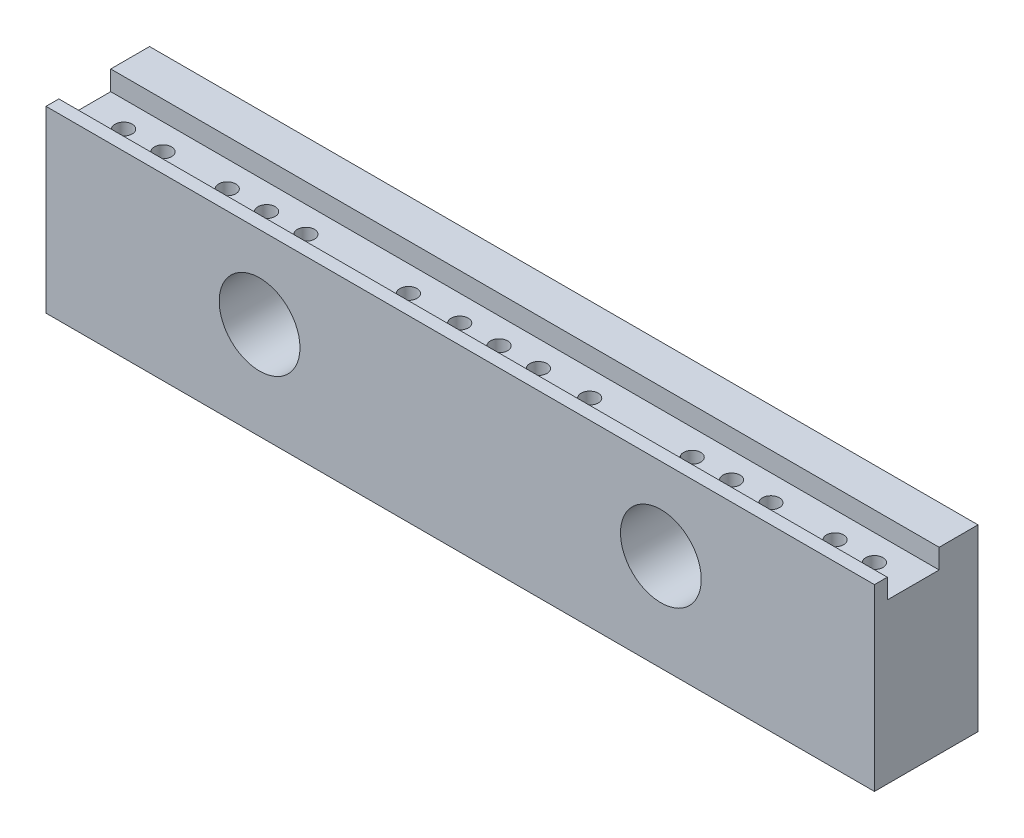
ISO-10303-21;
HEADER;
FILE_DESCRIPTION(('STEP AP214'),'2;1');
FILE_NAME('part.step','',(''),(''),'','','');
FILE_SCHEMA(('AUTOMOTIVE_DESIGN { 1 0 10303 214 1 1 1 1 }'));
ENDSEC;
DATA;
#1=APPLICATION_CONTEXT('core data for automotive mechanical design processes');
#2=APPLICATION_PROTOCOL_DEFINITION('international standard','automotive_design',2000,#1);
#3=PRODUCT_CONTEXT('',#1,'mechanical');
#4=PRODUCT('Part','Part','',(#3));
#5=PRODUCT_RELATED_PRODUCT_CATEGORY('part','',(#4));
#6=PRODUCT_DEFINITION_FORMATION('','',#4);
#7=PRODUCT_DEFINITION_CONTEXT('part definition',#1,'design');
#8=PRODUCT_DEFINITION('design','',#6,#7);
#9=PRODUCT_DEFINITION_SHAPE('','',#8);
#10=(LENGTH_UNIT() NAMED_UNIT(*) SI_UNIT(.MILLI.,.METRE.));
#11=(NAMED_UNIT(*) PLANE_ANGLE_UNIT() SI_UNIT($,.RADIAN.));
#12=(NAMED_UNIT(*) SI_UNIT($,.STERADIAN.) SOLID_ANGLE_UNIT());
#13=UNCERTAINTY_MEASURE_WITH_UNIT(LENGTH_MEASURE(1.E-05),#10,'distance_accuracy_value','');
#14=(GEOMETRIC_REPRESENTATION_CONTEXT(3) GLOBAL_UNCERTAINTY_ASSIGNED_CONTEXT((#13)) GLOBAL_UNIT_ASSIGNED_CONTEXT((#10,
#11,#12)) REPRESENTATION_CONTEXT('',''));
#15=CARTESIAN_POINT('',(0.,0.,0.));
#16=DIRECTION('',(0.,0.,1.));
#17=DIRECTION('',(1.,0.,0.));
#18=AXIS2_PLACEMENT_3D('',#15,#16,#17);
#19=CARTESIAN_POINT('',(-49.2125,23.7998,-25.3999999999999));
#20=DIRECTION('',(0.,0.,1.));
#21=DIRECTION('',(1.,0.,0.));
#22=AXIS2_PLACEMENT_3D('',#19,#20,#21);
#23=CYLINDRICAL_SURFACE('',#22,6.74369999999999);
#24=CARTESIAN_POINT('',(-49.2125,23.7998,-25.3999999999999));
#25=DIRECTION('',(0.,0.,1.));
#26=DIRECTION('',(1.,0.,0.));
#27=AXIS2_PLACEMENT_3D('',#24,#25,#26);
#28=CIRCLE('',#27,6.74369999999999);
#29=CARTESIAN_POINT('',(-42.4688,23.7998,-25.3999999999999));
#30=VERTEX_POINT('',#29);
#31=EDGE_CURVE('E120',#30,#30,#28,.F.);
#32=ORIENTED_EDGE('',*,*,#31,.T.);
#33=EDGE_LOOP('',(#32));
#34=FACE_BOUND('',#33,.T.);
#35=CARTESIAN_POINT('',(-49.2125,23.7998,-16.002));
#36=DIRECTION('',(0.,0.,1.));
#37=DIRECTION('',(1.,0.,0.));
#38=AXIS2_PLACEMENT_3D('',#35,#36,#37);
#39=CIRCLE('',#38,6.74369999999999);
#40=CARTESIAN_POINT('',(-42.4688,23.7998,-16.002));
#41=VERTEX_POINT('',#40);
#42=EDGE_CURVE('E167',#41,#41,#39,.T.);
#43=ORIENTED_EDGE('',*,*,#42,.T.);
#44=EDGE_LOOP('',(#43));
#45=FACE_BOUND('',#44,.T.);
#46=ADVANCED_FACE('F43',(#34,#45),#23,.F.);
#47=CARTESIAN_POINT('',(49.2125,23.7998,-25.4));
#48=DIRECTION('',(0.,0.,1.));
#49=DIRECTION('',(1.,0.,0.));
#50=AXIS2_PLACEMENT_3D('',#47,#48,#49);
#51=CYLINDRICAL_SURFACE('',#50,6.74370000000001);
#52=CARTESIAN_POINT('',(49.2125,23.7998,-25.4));
#53=DIRECTION('',(0.,0.,1.));
#54=DIRECTION('',(1.,0.,0.));
#55=AXIS2_PLACEMENT_3D('',#52,#53,#54);
#56=CIRCLE('',#55,6.74370000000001);
#57=CARTESIAN_POINT('',(55.9562,23.7998,-25.4));
#58=VERTEX_POINT('',#57);
#59=EDGE_CURVE('E383',#58,#58,#56,.F.);
#60=ORIENTED_EDGE('',*,*,#59,.T.);
#61=EDGE_LOOP('',(#60));
#62=FACE_BOUND('',#61,.T.);
#63=CARTESIAN_POINT('',(49.2125,23.7998,-16.002));
#64=DIRECTION('',(0.,0.,1.));
#65=DIRECTION('',(1.,0.,0.));
#66=AXIS2_PLACEMENT_3D('',#63,#64,#65);
#67=CIRCLE('',#66,6.74370000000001);
#68=CARTESIAN_POINT('',(55.9562,23.7998,-16.002));
#69=VERTEX_POINT('',#68);
#70=EDGE_CURVE('E171',#69,#69,#67,.T.);
#71=ORIENTED_EDGE('',*,*,#70,.T.);
#72=EDGE_LOOP('',(#71));
#73=FACE_BOUND('',#72,.T.);
#74=ADVANCED_FACE('F391',(#62,#73),#51,.F.);
#75=CARTESIAN_POINT('',(-39.187628,13.774928,-16.002));
#76=DIRECTION('',(0.,0.,-1.));
#77=DIRECTION('',(-1.,0.,0.));
#78=AXIS2_PLACEMENT_3D('',#75,#76,#77);
#79=PLANE('',#78);
#80=ORIENTED_EDGE('',*,*,#42,.F.);
#81=EDGE_LOOP('',(#80));
#82=FACE_BOUND('',#81,.T.);
#83=CARTESIAN_POINT('',(-49.2125,23.7998,-16.002));
#84=DIRECTION('',(0.,0.,1.));
#85=DIRECTION('',(1.,0.,0.));
#86=AXIS2_PLACEMENT_3D('',#83,#84,#85);
#87=CIRCLE('',#86,9.906);
#88=CARTESIAN_POINT('',(-39.3065,23.7998,-16.002));
#89=VERTEX_POINT('',#88);
#90=EDGE_CURVE('E382',#89,#89,#87,.F.);
#91=ORIENTED_EDGE('',*,*,#90,.F.);
#92=EDGE_LOOP('',(#91));
#93=FACE_BOUND('',#92,.T.);
#94=ADVANCED_FACE('F395',(#82,#93),#79,.F.);
#95=CARTESIAN_POINT('',(59.237372,13.774928,-16.002));
#96=DIRECTION('',(0.,0.,-1.));
#97=DIRECTION('',(-1.,0.,0.));
#98=AXIS2_PLACEMENT_3D('',#95,#96,#97);
#99=PLANE('',#98);
#100=ORIENTED_EDGE('',*,*,#70,.F.);
#101=EDGE_LOOP('',(#100));
#102=FACE_BOUND('',#101,.T.);
#103=CARTESIAN_POINT('',(49.2125,23.7998,-16.002));
#104=DIRECTION('',(0.,0.,1.));
#105=DIRECTION('',(1.,0.,0.));
#106=AXIS2_PLACEMENT_3D('',#103,#104,#105);
#107=CIRCLE('',#106,9.90600000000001);
#108=CARTESIAN_POINT('',(59.1185,23.7998,-16.002));
#109=VERTEX_POINT('',#108);
#110=EDGE_CURVE('E325',#109,#109,#107,.F.);
#111=ORIENTED_EDGE('',*,*,#110,.F.);
#112=EDGE_LOOP('',(#111));
#113=FACE_BOUND('',#112,.T.);
#114=ADVANCED_FACE('F398',(#102,#113),#99,.F.);
#115=CARTESIAN_POINT('',(-76.2,0.,-25.4));
#116=DIRECTION('',(0.,1.,0.));
#117=DIRECTION('',(0.,0.,1.));
#118=AXIS2_PLACEMENT_3D('',#115,#116,#117);
#119=PLANE('',#118);
#120=DIRECTION('',(1.,0.,0.));
#121=VECTOR('',#120,1.);
#122=CARTESIAN_POINT('',(0.,0.,-25.4));
#123=LINE('',#122,#121);
#124=CARTESIAN_POINT('',(-101.6,0.,-25.4));
#125=VERTEX_POINT('',#124);
#126=CARTESIAN_POINT('',(101.6,0.,-25.4));
#127=VERTEX_POINT('',#126);
#128=EDGE_CURVE('E121',#125,#127,#123,.T.);
#129=ORIENTED_EDGE('',*,*,#128,.T.);
#130=DIRECTION('',(0.,0.,1.));
#131=VECTOR('',#130,1.);
#132=CARTESIAN_POINT('',(101.6,0.,-12.7));
#133=LINE('',#132,#131);
#134=CARTESIAN_POINT('',(101.6,0.,0.));
#135=VERTEX_POINT('',#134);
#136=EDGE_CURVE('E128',#127,#135,#133,.T.);
#137=ORIENTED_EDGE('',*,*,#136,.T.);
#138=DIRECTION('',(-1.,0.,0.));
#139=VECTOR('',#138,1.);
#140=CARTESIAN_POINT('',(0.,0.,0.));
#141=LINE('',#140,#139);
#142=CARTESIAN_POINT('',(-101.6,0.,0.));
#143=VERTEX_POINT('',#142);
#144=EDGE_CURVE('E192',#135,#143,#141,.T.);
#145=ORIENTED_EDGE('',*,*,#144,.T.);
#146=DIRECTION('',(0.,0.,1.));
#147=VECTOR('',#146,1.);
#148=CARTESIAN_POINT('',(-101.6,0.,-12.7));
#149=LINE('',#148,#147);
#150=EDGE_CURVE('E153',#125,#143,#149,.T.);
#151=ORIENTED_EDGE('',*,*,#150,.F.);
#152=EDGE_LOOP('',(#129,#137,#145,#151));
#153=FACE_BOUND('',#152,.T.);
#154=ADVANCED_FACE('F411',(#153),#119,.F.);
#155=CARTESIAN_POINT('',(76.2,0.,0.));
#156=DIRECTION('',(0.,0.,-1.));
#157=DIRECTION('',(-1.,0.,0.));
#158=AXIS2_PLACEMENT_3D('',#155,#156,#157);
#159=PLANE('',#158);
#160=CARTESIAN_POINT('',(49.2125,23.7998,0.));
#161=DIRECTION('',(0.,0.,1.));
#162=DIRECTION('',(1.,0.,0.));
#163=AXIS2_PLACEMENT_3D('',#160,#161,#162);
#164=CIRCLE('',#163,9.90600000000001);
#165=CARTESIAN_POINT('',(59.1185,23.7998,0.));
#166=VERTEX_POINT('',#165);
#167=EDGE_CURVE('E205',#166,#166,#164,.T.);
#168=ORIENTED_EDGE('',*,*,#167,.F.);
#169=EDGE_LOOP('',(#168));
#170=FACE_BOUND('',#169,.T.);
#171=CARTESIAN_POINT('',(-49.2125,23.7998,0.));
#172=DIRECTION('',(0.,0.,1.));
#173=DIRECTION('',(1.,0.,0.));
#174=AXIS2_PLACEMENT_3D('',#171,#172,#173);
#175=CIRCLE('',#174,9.906);
#176=CARTESIAN_POINT('',(-39.3065,23.7998,0.));
#177=VERTEX_POINT('',#176);
#178=EDGE_CURVE('E326',#177,#177,#175,.T.);
#179=ORIENTED_EDGE('',*,*,#178,.F.);
#180=EDGE_LOOP('',(#179));
#181=FACE_BOUND('',#180,.T.);
#182=ORIENTED_EDGE('',*,*,#144,.F.);
#183=DIRECTION('',(0.,1.,0.));
#184=VECTOR('',#183,1.);
#185=CARTESIAN_POINT('',(101.6,21.971,0.));
#186=LINE('',#185,#184);
#187=CARTESIAN_POINT('',(101.6,43.942,0.));
#188=VERTEX_POINT('',#187);
#189=EDGE_CURVE('E135',#135,#188,#186,.T.);
#190=ORIENTED_EDGE('',*,*,#189,.T.);
#191=DIRECTION('',(-1.,0.,0.));
#192=VECTOR('',#191,1.);
#193=CARTESIAN_POINT('',(0.,43.942,0.));
#194=LINE('',#193,#192);
#195=CARTESIAN_POINT('',(-101.6,43.942,0.));
#196=VERTEX_POINT('',#195);
#197=EDGE_CURVE('E187',#188,#196,#194,.T.);
#198=ORIENTED_EDGE('',*,*,#197,.T.);
#199=DIRECTION('',(0.,1.,0.));
#200=VECTOR('',#199,1.);
#201=CARTESIAN_POINT('',(-101.6,21.971,0.));
#202=LINE('',#201,#200);
#203=EDGE_CURVE('E155',#143,#196,#202,.T.);
#204=ORIENTED_EDGE('',*,*,#203,.F.);
#205=EDGE_LOOP('',(#182,#190,#198,#204));
#206=FACE_BOUND('',#205,.T.);
#207=ADVANCED_FACE('F407',(#170,#181,#206),#159,.F.);
#208=CARTESIAN_POINT('',(-76.2,43.942,0.));
#209=DIRECTION('',(0.,-1.,0.));
#210=DIRECTION('',(0.,0.,-1.));
#211=AXIS2_PLACEMENT_3D('',#208,#209,#210);
#212=PLANE('',#211);
#213=ORIENTED_EDGE('',*,*,#197,.F.);
#214=DIRECTION('',(0.,0.,-1.));
#215=VECTOR('',#214,1.);
#216=CARTESIAN_POINT('',(101.6,43.942,-12.7));
#217=LINE('',#216,#215);
#218=CARTESIAN_POINT('',(101.6,43.942,-3.1496));
#219=VERTEX_POINT('',#218);
#220=EDGE_CURVE('E132',#188,#219,#217,.T.);
#221=ORIENTED_EDGE('',*,*,#220,.T.);
#222=DIRECTION('',(-1.,0.,0.));
#223=VECTOR('',#222,1.);
#224=CARTESIAN_POINT('',(0.,43.942,-3.1496));
#225=LINE('',#224,#223);
#226=CARTESIAN_POINT('',(-101.6,43.942,-3.14959999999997));
#227=VERTEX_POINT('',#226);
#228=EDGE_CURVE('E145',#219,#227,#225,.T.);
#229=ORIENTED_EDGE('',*,*,#228,.T.);
#230=DIRECTION('',(0.,0.,-1.));
#231=VECTOR('',#230,1.);
#232=CARTESIAN_POINT('',(-101.6,43.942,-12.7));
#233=LINE('',#232,#231);
#234=EDGE_CURVE('E157',#196,#227,#233,.T.);
#235=ORIENTED_EDGE('',*,*,#234,.F.);
#236=EDGE_LOOP('',(#213,#221,#229,#235));
#237=FACE_BOUND('',#236,.T.);
#238=ADVANCED_FACE('F410',(#237),#212,.F.);
#239=CARTESIAN_POINT('',(-76.2,43.942,-15.875));
#240=DIRECTION('',(0.,-1.,0.));
#241=DIRECTION('',(0.,0.,-1.));
#242=AXIS2_PLACEMENT_3D('',#239,#240,#241);
#243=PLANE('',#242);
#244=DIRECTION('',(1.,0.,0.));
#245=VECTOR('',#244,1.);
#246=CARTESIAN_POINT('',(0.,43.942,-15.875));
#247=LINE('',#246,#245);
#248=CARTESIAN_POINT('',(-101.6,43.942,-15.875));
#249=VERTEX_POINT('',#248);
#250=CARTESIAN_POINT('',(101.6,43.942,-15.875));
#251=VERTEX_POINT('',#250);
#252=EDGE_CURVE('E107',#249,#251,#247,.T.);
#253=ORIENTED_EDGE('',*,*,#252,.T.);
#254=DIRECTION('',(0.,0.,-1.));
#255=VECTOR('',#254,1.);
#256=CARTESIAN_POINT('',(101.6,43.942,-12.7));
#257=LINE('',#256,#255);
#258=CARTESIAN_POINT('',(101.6,43.942,-25.4));
#259=VERTEX_POINT('',#258);
#260=EDGE_CURVE('E47',#251,#259,#257,.T.);
#261=ORIENTED_EDGE('',*,*,#260,.T.);
#262=DIRECTION('',(-1.,0.,0.));
#263=VECTOR('',#262,1.);
#264=CARTESIAN_POINT('',(0.,43.942,-25.4));
#265=LINE('',#264,#263);
#266=CARTESIAN_POINT('',(-101.6,43.942,-25.3999999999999));
#267=VERTEX_POINT('',#266);
#268=EDGE_CURVE('E114',#259,#267,#265,.T.);
#269=ORIENTED_EDGE('',*,*,#268,.T.);
#270=DIRECTION('',(0.,0.,-1.));
#271=VECTOR('',#270,1.);
#272=CARTESIAN_POINT('',(-101.6,43.942,-12.7));
#273=LINE('',#272,#271);
#274=EDGE_CURVE('E152',#249,#267,#273,.T.);
#275=ORIENTED_EDGE('',*,*,#274,.F.);
#276=EDGE_LOOP('',(#253,#261,#269,#275));
#277=FACE_BOUND('',#276,.T.);
#278=ADVANCED_FACE('F130',(#277),#243,.F.);
#279=CARTESIAN_POINT('',(-76.2,43.942,-25.4));
#280=DIRECTION('',(0.,0.,1.));
#281=DIRECTION('',(0.,-1.,0.));
#282=AXIS2_PLACEMENT_3D('',#279,#280,#281);
#283=PLANE('',#282);
#284=ORIENTED_EDGE('',*,*,#59,.F.);
#285=EDGE_LOOP('',(#284));
#286=FACE_BOUND('',#285,.T.);
#287=ORIENTED_EDGE('',*,*,#31,.F.);
#288=EDGE_LOOP('',(#287));
#289=FACE_BOUND('',#288,.T.);
#290=ORIENTED_EDGE('',*,*,#268,.F.);
#291=DIRECTION('',(0.,-1.,0.));
#292=VECTOR('',#291,1.);
#293=CARTESIAN_POINT('',(101.6,21.971,-25.4));
#294=LINE('',#293,#292);
#295=EDGE_CURVE('E117',#259,#127,#294,.T.);
#296=ORIENTED_EDGE('',*,*,#295,.T.);
#297=ORIENTED_EDGE('',*,*,#128,.F.);
#298=DIRECTION('',(0.,-1.,0.));
#299=VECTOR('',#298,1.);
#300=CARTESIAN_POINT('',(-101.6,21.971,-25.4));
#301=LINE('',#300,#299);
#302=EDGE_CURVE('E119',#267,#125,#301,.T.);
#303=ORIENTED_EDGE('',*,*,#302,.F.);
#304=EDGE_LOOP('',(#290,#296,#297,#303));
#305=FACE_BOUND('',#304,.T.);
#306=ADVANCED_FACE('F116',(#286,#289,#305),#283,.F.);
#307=CARTESIAN_POINT('',(66.675,25.6621926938,-9.52499999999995));
#308=DIRECTION('',(0.,1.,0.));
#309=DIRECTION('',(0.,0.,1.));
#310=AXIS2_PLACEMENT_3D('',#307,#308,#309);
#311=CONICAL_SURFACE('',#310,0.,1.02974425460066);
#312=CARTESIAN_POINT('',(66.675,25.6621926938,-9.52499999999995));
#313=VERTEX_POINT('',#312);
#314=VERTEX_LOOP('',#313);
#315=FACE_BOUND('',#314,.T.);
#316=CARTESIAN_POINT('',(66.675,26.924,-9.52499999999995));
#317=DIRECTION('',(0.,1.,0.));
#318=DIRECTION('',(0.,0.,1.));
#319=AXIS2_PLACEMENT_3D('',#316,#317,#318);
#320=CIRCLE('',#319,2.099999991);
#321=CARTESIAN_POINT('',(66.675,26.924,-7.42500000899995));
#322=VERTEX_POINT('',#321);
#323=EDGE_CURVE('E151',#322,#322,#320,.F.);
#324=ORIENTED_EDGE('',*,*,#323,.F.);
#325=EDGE_LOOP('',(#324));
#326=FACE_BOUND('',#325,.T.);
#327=ADVANCED_FACE('F238',(#315,#326),#311,.F.);
#328=CARTESIAN_POINT('',(0.,25.6621926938,-9.52499999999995));
#329=DIRECTION('',(0.,1.,0.));
#330=DIRECTION('',(0.,0.,1.));
#331=AXIS2_PLACEMENT_3D('',#328,#329,#330);
#332=CONICAL_SURFACE('',#331,0.,1.02974425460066);
#333=CARTESIAN_POINT('',(0.,25.6621926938,-9.52499999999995));
#334=VERTEX_POINT('',#333);
#335=VERTEX_LOOP('',#334);
#336=FACE_BOUND('',#335,.T.);
#337=CARTESIAN_POINT('',(0.,26.924,-9.52499999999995));
#338=DIRECTION('',(0.,1.,0.));
#339=DIRECTION('',(0.,0.,1.));
#340=AXIS2_PLACEMENT_3D('',#337,#338,#339);
#341=CIRCLE('',#340,2.099999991);
#342=CARTESIAN_POINT('',(0.,26.924,-7.42500000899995));
#343=VERTEX_POINT('',#342);
#344=EDGE_CURVE('E230',#343,#343,#341,.F.);
#345=ORIENTED_EDGE('',*,*,#344,.F.);
#346=EDGE_LOOP('',(#345));
#347=FACE_BOUND('',#346,.T.);
#348=ADVANCED_FACE('F240',(#336,#347),#332,.F.);
#349=CARTESIAN_POINT('',(-22.225,25.6621926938,-9.52499999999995));
#350=DIRECTION('',(0.,1.,0.));
#351=DIRECTION('',(0.,0.,1.));
#352=AXIS2_PLACEMENT_3D('',#349,#350,#351);
#353=CONICAL_SURFACE('',#352,0.,1.02974425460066);
#354=CARTESIAN_POINT('',(-22.225,25.6621926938,-9.52499999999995));
#355=VERTEX_POINT('',#354);
#356=VERTEX_LOOP('',#355);
#357=FACE_BOUND('',#356,.T.);
#358=CARTESIAN_POINT('',(-22.225,26.924,-9.52499999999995));
#359=DIRECTION('',(0.,1.,0.));
#360=DIRECTION('',(0.,0.,1.));
#361=AXIS2_PLACEMENT_3D('',#358,#359,#360);
#362=CIRCLE('',#361,2.099999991);
#363=CARTESIAN_POINT('',(-22.225,26.924,-7.42500000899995));
#364=VERTEX_POINT('',#363);
#365=EDGE_CURVE('E227',#364,#364,#362,.F.);
#366=ORIENTED_EDGE('',*,*,#365,.F.);
#367=EDGE_LOOP('',(#366));
#368=FACE_BOUND('',#367,.T.);
#369=ADVANCED_FACE('F247',(#357,#368),#353,.F.);
#370=CARTESIAN_POINT('',(-57.023,26.6650445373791,-9.52499999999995));
#371=DIRECTION('',(0.,1.,0.));
#372=DIRECTION('',(0.,0.,1.));
#373=AXIS2_PLACEMENT_3D('',#370,#371,#372);
#374=CONICAL_SURFACE('',#373,1.66902571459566,1.02974427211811);
#375=CARTESIAN_POINT('',(-57.023,26.924,-9.52499999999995));
#376=DIRECTION('',(0.,1.,0.));
#377=DIRECTION('',(0.,0.,1.));
#378=AXIS2_PLACEMENT_3D('',#375,#376,#377);
#379=CIRCLE('',#378,2.099999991);
#380=CARTESIAN_POINT('',(-58.6129367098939,26.9240000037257,-8.15310305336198));
#381=VERTEX_POINT('',#380);
#382=CARTESIAN_POINT('',(-58.6129367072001,26.9240000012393,-10.8968969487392));
#383=VERTEX_POINT('',#382);
#384=EDGE_CURVE('E223',#381,#383,#379,.F.);
#385=ORIENTED_EDGE('',*,*,#384,.F.);
#386=CARTESIAN_POINT('',(-58.6129367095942,26.9240000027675,-10.8968969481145));
#387=CARTESIAN_POINT('',(-58.6195759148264,26.9040249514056,-10.838299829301));
#388=CARTESIAN_POINT('',(-58.6258952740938,26.884795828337,-10.7794113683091));
#389=CARTESIAN_POINT('',(-58.6378368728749,26.8481160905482,-10.6609780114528));
#390=CARTESIAN_POINT('',(-58.6434587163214,26.8306664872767,-10.6014327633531));
#391=CARTESIAN_POINT('',(-58.6592309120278,26.7812939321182,-10.4212302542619));
#392=CARTESIAN_POINT('',(-58.6682234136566,26.7525435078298,-10.2995642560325));
#393=CARTESIAN_POINT('',(-58.6822421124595,26.7072696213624,-10.0585199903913));
#394=CARTESIAN_POINT('',(-58.6874077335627,26.6903178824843,-9.93923409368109));
#395=CARTESIAN_POINT('',(-58.6922433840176,26.6744002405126,-9.75955362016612));
#396=CARTESIAN_POINT('',(-58.6933701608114,26.6706782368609,-9.69960145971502));
#397=CARTESIAN_POINT('',(-58.6946338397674,26.6665016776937,-9.57957422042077));
#398=CARTESIAN_POINT('',(-58.6947707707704,26.6660470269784,-9.51949914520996));
#399=CARTESIAN_POINT('',(-58.693746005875,26.6694389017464,-9.34989874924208));
#400=CARTESIAN_POINT('',(-58.6914206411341,26.6771403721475,-9.24043636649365));
#401=CARTESIAN_POINT('',(-58.6836327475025,26.7026690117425,-9.02262278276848));
#402=CARTESIAN_POINT('',(-58.6781631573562,26.7205189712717,-8.91427464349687));
#403=CARTESIAN_POINT('',(-58.6642263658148,26.7653122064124,-8.69557280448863));
#404=CARTESIAN_POINT('',(-58.655656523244,26.7925651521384,-8.58529142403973));
#405=CARTESIAN_POINT('',(-58.6360411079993,26.853774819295,-8.36735528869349));
#406=CARTESIAN_POINT('',(-58.6250070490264,26.8877002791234,-8.25969082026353));
#407=CARTESIAN_POINT('',(-58.6129367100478,26.9240000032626,-8.15310304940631));
#408=B_SPLINE_CURVE_WITH_KNOTS('',3,(#386,#387,#388,#389,#390,#391,#392,#393,#394,#395,#396,
#397,#398,#399,#400,#401,#402,#403,#404,#405,#406,#407),.UNSPECIFIED.,.F.,.F.,(4,2,2,2,2,2,2,2,
2,2,4),(0.,0.186779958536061,0.373665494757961,0.749217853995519,1.11030567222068,
1.29045224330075,1.47059356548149,1.79924548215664,2.12863838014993,2.47011946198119,
2.8100372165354),.UNSPECIFIED.);
#409=EDGE_CURVE('E375',#383,#381,#408,.T.);
#410=ORIENTED_EDGE('',*,*,#409,.F.);
#411=EDGE_LOOP('',(#385,#410));
#412=FACE_BOUND('',#411,.T.);
#413=ADVANCED_FACE('F367',(#412),#374,.F.);
#414=CARTESIAN_POINT('',(-49.2125,23.7998,-16.002));
#415=DIRECTION('',(0.,0.,1.));
#416=DIRECTION('',(1.,0.,0.));
#417=AXIS2_PLACEMENT_3D('',#414,#415,#416);
#418=CYLINDRICAL_SURFACE('',#417,9.906);
#419=ORIENTED_EDGE('',*,*,#90,.T.);
#420=EDGE_LOOP('',(#419));
#421=FACE_BOUND('',#420,.T.);
#422=ORIENTED_EDGE('',*,*,#178,.T.);
#423=EDGE_LOOP('',(#422));
#424=FACE_BOUND('',#423,.T.);
#425=CARTESIAN_POINT('',(-58.6129367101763,26.9240000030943,-10.8968969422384));
#426=CARTESIAN_POINT('',(-58.5781590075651,27.0286372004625,-10.9371963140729));
#427=CARTESIAN_POINT('',(-58.5415314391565,27.1330136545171,-10.9765526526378));
#428=CARTESIAN_POINT('',(-58.4645047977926,27.341208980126,-11.0530757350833));
#429=CARTESIAN_POINT('',(-58.4241047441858,27.4450276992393,-11.090241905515));
#430=CARTESIAN_POINT('',(-58.2968039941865,27.7563987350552,-11.1982765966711));
#431=CARTESIAN_POINT('',(-58.2040997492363,27.9629674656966,-11.2653302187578));
#432=CARTESIAN_POINT('',(-58.0035464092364,28.371209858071,-11.3856815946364));
#433=CARTESIAN_POINT('',(-57.8957863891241,28.572904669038,-11.4390553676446));
#434=CARTESIAN_POINT('',(-57.6648130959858,28.9708682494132,-11.5283402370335));
#435=CARTESIAN_POINT('',(-57.5416357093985,29.1671483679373,-11.5642909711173));
#436=CARTESIAN_POINT('',(-57.349609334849,29.4503123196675,-11.6003837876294));
#437=CARTESIAN_POINT('',(-57.2865578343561,29.5400527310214,-11.6094061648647));
#438=CARTESIAN_POINT('',(-57.1571616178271,29.717847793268,-11.6217203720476));
#439=CARTESIAN_POINT('',(-57.0908102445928,29.8058984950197,-11.6250000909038));
#440=CARTESIAN_POINT('',(-56.9522391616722,29.9835292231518,-11.6249998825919));
#441=CARTESIAN_POINT('',(-56.8798897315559,30.0730090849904,-11.6214283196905));
#442=CARTESIAN_POINT('',(-56.7324291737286,30.249039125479,-11.6061212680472));
#443=CARTESIAN_POINT('',(-56.6573169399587,30.3355881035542,-11.5943824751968));
#444=CARTESIAN_POINT('',(-56.5051500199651,30.5049488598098,-11.561633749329));
#445=CARTESIAN_POINT('',(-56.4280986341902,30.5877663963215,-11.5406386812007));
#446=CARTESIAN_POINT('',(-56.2729926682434,30.7489570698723,-11.4882079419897));
#447=CARTESIAN_POINT('',(-56.1949389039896,30.827333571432,-11.4567803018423));
#448=CARTESIAN_POINT('',(-56.0229063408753,30.9945467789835,-11.3745120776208));
#449=CARTESIAN_POINT('',(-55.9289912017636,31.0821694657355,-11.3209936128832));
#450=CARTESIAN_POINT('',(-55.7451456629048,31.2475261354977,-11.1951663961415));
#451=CARTESIAN_POINT('',(-55.6552099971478,31.3252734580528,-11.122883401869));
#452=CARTESIAN_POINT('',(-55.4972836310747,31.4574270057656,-10.9714496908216));
#453=CARTESIAN_POINT('',(-55.4280582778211,31.5135823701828,-10.8951298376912));
#454=CARTESIAN_POINT('',(-55.2990697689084,31.6157629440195,-10.7287949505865));
#455=CARTESIAN_POINT('',(-55.2393049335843,31.6617899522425,-10.6387823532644));
#456=CARTESIAN_POINT('',(-55.1324486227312,31.7425695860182,-10.4458953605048));
#457=CARTESIAN_POINT('',(-55.0854492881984,31.777240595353,-10.3429349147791));
#458=CARTESIAN_POINT('',(-55.0080795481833,31.8336297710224,-10.1276183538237));
#459=CARTESIAN_POINT('',(-54.977697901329,31.8553566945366,-10.0152686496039));
#460=CARTESIAN_POINT('',(-54.9385753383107,31.883202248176,-9.79995684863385));
#461=CARTESIAN_POINT('',(-54.9275799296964,31.8909499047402,-9.69760932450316));
#462=CARTESIAN_POINT('',(-54.9207469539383,31.8957729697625,-9.49217719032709));
#463=CARTESIAN_POINT('',(-54.9249028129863,31.8928530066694,-9.38909291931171));
#464=CARTESIAN_POINT('',(-54.9474145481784,31.8769130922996,-9.19143178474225));
#465=CARTESIAN_POINT('',(-54.9649314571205,31.8644897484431,-9.09670859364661));
#466=CARTESIAN_POINT('',(-55.0121773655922,31.8305793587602,-8.91207844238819));
#467=CARTESIAN_POINT('',(-55.0419062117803,31.8090924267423,-8.8221714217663));
#468=CARTESIAN_POINT('',(-55.1129601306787,31.7568966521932,-8.64697913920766));
#469=CARTESIAN_POINT('',(-55.1545710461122,31.7259589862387,-8.56187894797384));
#470=CARTESIAN_POINT('',(-55.2469685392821,31.655841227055,-8.40056071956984));
#471=CARTESIAN_POINT('',(-55.2977574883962,31.6166590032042,-8.32434498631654));
#472=CARTESIAN_POINT('',(-55.4118284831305,31.5265678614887,-8.17449383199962));
#473=CARTESIAN_POINT('',(-55.4758548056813,31.4748732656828,-8.10190113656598));
#474=CARTESIAN_POINT('',(-55.6096100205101,31.3637547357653,-7.96896621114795));
#475=CARTESIAN_POINT('',(-55.6793428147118,31.3043254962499,-7.9086324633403));
#476=CARTESIAN_POINT('',(-55.8575763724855,31.1477172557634,-7.77291207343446));
#477=CARTESIAN_POINT('',(-55.9681347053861,31.0464460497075,-7.7049257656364));
#478=CARTESIAN_POINT('',(-56.190480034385,30.8326206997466,-7.59303785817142));
#479=CARTESIAN_POINT('',(-56.3022689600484,30.7200455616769,-7.54918209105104));
#480=CARTESIAN_POINT('',(-56.5183565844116,30.4913637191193,-7.48354504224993));
#481=CARTESIAN_POINT('',(-56.6227729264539,30.3756022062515,-7.46091642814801));
#482=CARTESIAN_POINT('',(-56.8267819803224,30.1382571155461,-7.43165009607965));
#483=CARTESIAN_POINT('',(-56.9263784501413,30.0166782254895,-7.42499971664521));
#484=CARTESIAN_POINT('',(-57.1192028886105,29.7695038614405,-7.42500030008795));
#485=CARTESIAN_POINT('',(-57.2124565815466,29.6439280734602,-7.4315937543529));
#486=CARTESIAN_POINT('',(-57.392485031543,29.3891680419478,-7.45576476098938));
#487=CARTESIAN_POINT('',(-57.4792553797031,29.2599814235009,-7.47334971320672));
#488=CARTESIAN_POINT('',(-57.6463231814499,28.9982310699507,-7.51776988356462));
#489=CARTESIAN_POINT('',(-57.7265892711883,28.8656546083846,-7.54464697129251));
#490=CARTESIAN_POINT('',(-57.8800833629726,28.5982988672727,-7.60608376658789));
#491=CARTESIAN_POINT('',(-57.9533131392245,28.4635201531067,-7.64064153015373));
#492=CARTESIAN_POINT('',(-58.0824084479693,28.2123313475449,-7.71055500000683));
#493=CARTESIAN_POINT('',(-58.1392374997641,28.0961666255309,-7.74502965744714));
#494=CARTESIAN_POINT('',(-58.2478703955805,27.8627409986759,-7.8179639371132));
#495=CARTESIAN_POINT('',(-58.2996740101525,27.7454800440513,-7.85642374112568));
#496=CARTESIAN_POINT('',(-58.3978093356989,27.5112537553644,-7.93633259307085));
#497=CARTESIAN_POINT('',(-58.4441916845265,27.3942977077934,-7.9777469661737));
#498=CARTESIAN_POINT('',(-58.5321474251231,27.1596650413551,-8.06341396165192));
#499=CARTESIAN_POINT('',(-58.5737223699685,27.0419886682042,-8.10766566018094));
#500=CARTESIAN_POINT('',(-58.6129367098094,26.92400000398,-8.15310305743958));
#501=B_SPLINE_CURVE_WITH_KNOTS('',3,(#425,#426,#427,#428,#429,#430,#431,#432,#433,#434,#435,
#436,#437,#438,#439,#440,#441,#442,#443,#444,#445,#446,#447,#448,#449,#450,#451,#452,#453,#454,
#455,#456,#457,#458,#459,#460,#461,#462,#463,#464,#465,#466,#467,#468,#469,#470,#471,#472,#473,
#474,#475,#476,#477,#478,#479,#480,#481,#482,#483,#484,#485,#486,#487,#488,#489,#490,#491,#492,
#493,#494,#495,#496,#497,#498,#499,#500),.UNSPECIFIED.,.F.,.F.,(4,2,2,2,2,2,2,2,2,2,2,2,2,2,2,2,
2,2,2,2,2,2,2,2,2,2,2,2,2,2,2,2,2,2,2,2,2,4),(0.,0.352156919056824,0.704405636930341,
1.41192312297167,2.11541923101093,2.81730727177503,3.14727742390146,3.47794263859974,
3.82299590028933,4.16818883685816,4.51282942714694,4.85720532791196,5.27319369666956,
5.68861403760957,6.03922287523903,6.38976939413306,6.74278268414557,7.09555687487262,
7.40362634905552,7.71156217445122,8.00160865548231,8.29165149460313,8.5893636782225,
8.88715289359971,9.21509555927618,9.54326436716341,10.0343769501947,10.5264191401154,
10.9978606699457,11.468928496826,11.9379552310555,12.4072980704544,12.8787839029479,
13.350150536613,13.7514988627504,14.1528655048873,14.5501187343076,14.947243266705),.UNSPECIFIED.);
#502=EDGE_CURVE('E222',#383,#381,#501,.T.);
#503=ORIENTED_EDGE('',*,*,#502,.F.);
#504=ORIENTED_EDGE('',*,*,#409,.T.);
#505=EDGE_LOOP('',(#503,#504));
#506=FACE_BOUND('',#505,.T.);
#507=CARTESIAN_POINT('',(-47.3710000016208,33.5331300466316,-11.624999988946));
#508=CARTESIAN_POINT('',(-47.2501717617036,33.5102665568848,-11.6249942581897));
#509=CARTESIAN_POINT('',(-47.1296256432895,33.4851058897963,-11.6145288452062));
#510=CARTESIAN_POINT('',(-46.8927207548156,33.4311187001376,-11.57335693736));
#511=CARTESIAN_POINT('',(-46.7763718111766,33.4022842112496,-11.5426058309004));
#512=CARTESIAN_POINT('',(-46.5513679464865,33.3423747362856,-11.4621214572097));
#513=CARTESIAN_POINT('',(-46.4426961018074,33.311305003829,-11.4124315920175));
#514=CARTESIAN_POINT('',(-46.235497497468,33.2485049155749,-11.2955327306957));
#515=CARTESIAN_POINT('',(-46.1369677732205,33.2167747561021,-11.228328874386));
#516=CARTESIAN_POINT('',(-45.9501846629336,33.1537346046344,-11.0761745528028));
#517=CARTESIAN_POINT('',(-45.8622409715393,33.1224537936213,-10.9908308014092));
#518=CARTESIAN_POINT('',(-45.7020285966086,33.0633163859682,-10.8054447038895));
#519=CARTESIAN_POINT('',(-45.6297605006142,33.0354599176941,-10.7054018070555));
#520=CARTESIAN_POINT('',(-45.5046967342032,32.9859568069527,-10.4953287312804));
#521=CARTESIAN_POINT('',(-45.4515265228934,32.9641928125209,-10.385550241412));
#522=CARTESIAN_POINT('',(-45.3647676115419,32.928108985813,-10.1573775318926));
#523=CARTESIAN_POINT('',(-45.3311661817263,32.9137843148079,-10.0389889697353));
#524=CARTESIAN_POINT('',(-45.2868114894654,32.8947626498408,-9.80632228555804));
#525=CARTESIAN_POINT('',(-45.274562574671,32.88943631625,-9.69238000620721));
#526=CARTESIAN_POINT('',(-45.2687835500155,32.8869311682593,-9.46394727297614));
#527=CARTESIAN_POINT('',(-45.2752478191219,32.8897499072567,-9.34945699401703));
#528=CARTESIAN_POINT('',(-45.3058126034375,32.902924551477,-9.1290437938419));
#529=CARTESIAN_POINT('',(-45.3290395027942,32.9129069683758,-9.02297509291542));
#530=CARTESIAN_POINT('',(-45.3912251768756,32.9391558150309,-8.81638670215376));
#531=CARTESIAN_POINT('',(-45.4301861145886,32.9554231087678,-8.71586777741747));
#532=CARTESIAN_POINT('',(-45.5238975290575,32.9935843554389,-8.51982793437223));
#533=CARTESIAN_POINT('',(-45.5790870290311,33.0156326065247,-8.42454775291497));
#534=CARTESIAN_POINT('',(-45.7030696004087,33.0635543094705,-8.24438448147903));
#535=CARTESIAN_POINT('',(-45.7718660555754,33.089428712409,-8.15950398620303));
#536=CARTESIAN_POINT('',(-45.9268241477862,33.1454102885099,-7.99596173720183));
#537=CARTESIAN_POINT('',(-46.0138901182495,33.1756887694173,-7.91821470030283));
#538=CARTESIAN_POINT('',(-46.1995570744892,33.2369906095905,-7.77821696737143));
#539=CARTESIAN_POINT('',(-46.2981667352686,33.2680145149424,-7.71597803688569));
#540=CARTESIAN_POINT('',(-46.5094896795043,33.3305544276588,-7.60597341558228));
#541=CARTESIAN_POINT('',(-46.6226517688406,33.3620230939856,-7.5590415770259));
#542=CARTESIAN_POINT('',(-46.8559177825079,33.4221584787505,-7.48549421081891));
#543=CARTESIAN_POINT('',(-46.9760057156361,33.4508312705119,-7.4588337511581));
#544=CARTESIAN_POINT('',(-47.1429530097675,33.4873163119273,-7.43692000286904));
#545=CARTESIAN_POINT('',(-47.1883534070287,33.4969041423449,-7.43245979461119));
#546=CARTESIAN_POINT('',(-47.2794746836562,33.5154786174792,-7.42649861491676));
#547=CARTESIAN_POINT('',(-47.3251955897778,33.5244652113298,-7.42499789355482));
#548=CARTESIAN_POINT('',(-47.4859972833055,33.5548841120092,-7.42500532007));
#549=CARTESIAN_POINT('',(-47.6015209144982,33.5746100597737,-7.43448330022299));
#550=CARTESIAN_POINT('',(-47.830225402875,33.609570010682,-7.47254072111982));
#551=CARTESIAN_POINT('',(-47.9434019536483,33.6247963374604,-7.50115253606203));
#552=CARTESIAN_POINT('',(-48.1639033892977,33.6507695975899,-7.57695356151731));
#553=CARTESIAN_POINT('',(-48.2712290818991,33.6615171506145,-7.62414020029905));
#554=CARTESIAN_POINT('',(-48.4767397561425,33.6789772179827,-7.7358613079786));
#555=CARTESIAN_POINT('',(-48.5749278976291,33.6856911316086,-7.80038974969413));
#556=CARTESIAN_POINT('',(-48.7585980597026,33.6958205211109,-7.94446368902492));
#557=CARTESIAN_POINT('',(-48.8441682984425,33.699259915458,-8.02389513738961));
#558=CARTESIAN_POINT('',(-49.0010139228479,33.7038537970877,-8.19586459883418));
#559=CARTESIAN_POINT('',(-49.0722878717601,33.7050080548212,-8.28840392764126));
#560=CARTESIAN_POINT('',(-49.1990166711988,33.7059957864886,-8.48475394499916));
#561=CARTESIAN_POINT('',(-49.2543469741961,33.7058191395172,-8.58864507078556));
#562=CARTESIAN_POINT('',(-49.3469056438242,33.7049968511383,-8.80419800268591));
#563=CARTESIAN_POINT('',(-49.3841336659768,33.7043512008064,-8.91585995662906));
#564=CARTESIAN_POINT('',(-49.4396178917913,33.7032356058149,-9.14454184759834));
#565=CARTESIAN_POINT('',(-49.4577546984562,33.7027667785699,-9.26159078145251));
#566=CARTESIAN_POINT('',(-49.4741287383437,33.7023479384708,-9.49707327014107));
#567=CARTESIAN_POINT('',(-49.4723658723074,33.7023979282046,-9.615506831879));
#568=CARTESIAN_POINT('',(-49.4489886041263,33.7029834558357,-9.8504210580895));
#569=CARTESIAN_POINT('',(-49.4273702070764,33.703519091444,-9.96690132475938));
#570=CARTESIAN_POINT('',(-49.3648892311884,33.7046766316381,-10.1945834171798));
#571=CARTESIAN_POINT('',(-49.3240261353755,33.7052985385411,-10.3057851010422));
#572=CARTESIAN_POINT('',(-49.2241977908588,33.7059182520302,-10.5197878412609));
#573=CARTESIAN_POINT('',(-49.1652269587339,33.7059158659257,-10.6225862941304));
#574=CARTESIAN_POINT('',(-49.030870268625,33.7043617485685,-10.8168094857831));
#575=CARTESIAN_POINT('',(-48.9554857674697,33.7028101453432,-10.9082351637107));
#576=CARTESIAN_POINT('',(-48.7907220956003,33.6971581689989,-11.0768517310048));
#577=CARTESIAN_POINT('',(-48.701384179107,33.6930652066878,-11.1540831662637));
#578=CARTESIAN_POINT('',(-48.5111569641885,33.681399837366,-11.2924483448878));
#579=CARTESIAN_POINT('',(-48.410264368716,33.6738264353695,-11.3535774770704));
#580=CARTESIAN_POINT('',(-48.200911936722,33.6545694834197,-11.4575633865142));
#581=CARTESIAN_POINT('',(-48.0925226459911,33.6429209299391,-11.500569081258));
#582=CARTESIAN_POINT('',(-47.870791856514,33.6151492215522,-11.5679369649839));
#583=CARTESIAN_POINT('',(-47.7574594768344,33.5990340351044,-11.5923320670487));
#584=CARTESIAN_POINT('',(-47.5981123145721,33.573474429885,-11.6131843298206));
#585=CARTESIAN_POINT('',(-47.5527251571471,33.5658692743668,-11.6176175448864));
#586=CARTESIAN_POINT('',(-47.4618787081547,33.5499942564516,-11.6235263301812));
#587=CARTESIAN_POINT('',(-47.416419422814,33.5417244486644,-11.6250021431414));
#588=CARTESIAN_POINT('',(-47.3710000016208,33.5331300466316,-11.624999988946));
#589=B_SPLINE_CURVE_WITH_KNOTS('',3,(#507,#508,#509,#510,#511,#512,#513,#514,#515,#516,#517,
#518,#519,#520,#521,#522,#523,#524,#525,#526,#527,#528,#529,#530,#531,#532,#533,#534,#535,#536,
#537,#538,#539,#540,#541,#542,#543,#544,#545,#546,#547,#548,#549,#550,#551,#552,#553,#554,#555,
#556,#557,#558,#559,#560,#561,#562,#563,#564,#565,#566,#567,#568,#569,#570,#571,#572,#573,#574,
#575,#576,#577,#578,#579,#580,#581,#582,#583,#584,#585,#586,#587,#588),.UNSPECIFIED.,.T.,.F.,(4,
2,2,2,2,2,2,2,2,2,2,2,2,2,2,2,2,2,2,2,2,2,2,2,2,2,2,2,2,2,2,2,2,2,2,2,2,2,2,2,4),(0.,
0.368738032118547,0.738289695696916,1.10699949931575,1.47560121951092,1.85320393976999,
2.2308208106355,2.60056534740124,2.9700690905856,3.31245896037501,3.65474599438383,
3.98037490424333,4.30604859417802,4.64150222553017,4.97703938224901,5.33722225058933,
5.69767755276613,6.07535953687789,6.4522019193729,6.59197159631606,6.73175308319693,
7.08269070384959,7.43422361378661,7.78570787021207,8.13707012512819,8.48584573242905,
8.83465637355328,9.18612221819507,9.53759475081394,9.89125257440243,10.2449121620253,
10.5986429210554,10.9523831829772,11.3062326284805,11.6600528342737,12.0128460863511,
12.3657402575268,12.7156753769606,13.0649901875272,13.2036104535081,13.3422193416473),.UNSPECIFIED.);
#590=CARTESIAN_POINT('',(-47.3710000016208,33.5331300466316,-11.624999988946));
#591=VERTEX_POINT('',#590);
#592=EDGE_CURVE('E226',#591,#591,#589,.T.);
#593=ORIENTED_EDGE('',*,*,#592,.F.);
#594=EDGE_LOOP('',(#593));
#595=FACE_BOUND('',#594,.T.);
#596=ADVANCED_FACE('F361',(#421,#424,#506,#595),#418,.F.);
#597=CARTESIAN_POINT('',(-66.675,25.6621926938,-9.52499999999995));
#598=DIRECTION('',(0.,1.,0.));
#599=DIRECTION('',(0.,0.,1.));
#600=AXIS2_PLACEMENT_3D('',#597,#598,#599);
#601=CONICAL_SURFACE('',#600,0.,1.02974425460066);
#602=CARTESIAN_POINT('',(-66.675,25.6621926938,-9.52499999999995));
#603=VERTEX_POINT('',#602);
#604=VERTEX_LOOP('',#603);
#605=FACE_BOUND('',#604,.T.);
#606=CARTESIAN_POINT('',(-66.675,26.924,-9.52499999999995));
#607=DIRECTION('',(0.,1.,0.));
#608=DIRECTION('',(0.,0.,1.));
#609=AXIS2_PLACEMENT_3D('',#606,#607,#608);
#610=CIRCLE('',#609,2.099999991);
#611=CARTESIAN_POINT('',(-66.675,26.924,-7.42500000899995));
#612=VERTEX_POINT('',#611);
#613=EDGE_CURVE('E219',#612,#612,#610,.F.);
#614=ORIENTED_EDGE('',*,*,#613,.F.);
#615=EDGE_LOOP('',(#614));
#616=FACE_BOUND('',#615,.T.);
#617=ADVANCED_FACE('F366',(#605,#616),#601,.F.);
#618=CARTESIAN_POINT('',(-9.65200000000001,25.6621926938,-9.52499999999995));
#619=DIRECTION('',(0.,1.,0.));
#620=DIRECTION('',(0.,0.,1.));
#621=AXIS2_PLACEMENT_3D('',#618,#619,#620);
#622=CONICAL_SURFACE('',#621,0.,1.02974425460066);
#623=CARTESIAN_POINT('',(-9.65200000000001,25.6621926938,-9.52499999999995));
#624=VERTEX_POINT('',#623);
#625=VERTEX_LOOP('',#624);
#626=FACE_BOUND('',#625,.T.);
#627=CARTESIAN_POINT('',(-9.65200000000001,26.924,-9.52499999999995));
#628=DIRECTION('',(0.,1.,0.));
#629=DIRECTION('',(0.,0.,1.));
#630=AXIS2_PLACEMENT_3D('',#627,#628,#629);
#631=CIRCLE('',#630,2.099999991);
#632=CARTESIAN_POINT('',(-9.65200000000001,26.924,-7.42500000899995));
#633=VERTEX_POINT('',#632);
#634=EDGE_CURVE('E216',#633,#633,#631,.F.);
#635=ORIENTED_EDGE('',*,*,#634,.F.);
#636=EDGE_LOOP('',(#635));
#637=FACE_BOUND('',#636,.T.);
#638=ADVANCED_FACE('F582',(#626,#637),#622,.F.);
#639=CARTESIAN_POINT('',(22.225,25.6621926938,-9.52499999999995));
#640=DIRECTION('',(0.,1.,0.));
#641=DIRECTION('',(0.,0.,1.));
#642=AXIS2_PLACEMENT_3D('',#639,#640,#641);
#643=CONICAL_SURFACE('',#642,0.,1.02974425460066);
#644=CARTESIAN_POINT('',(22.225,25.6621926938,-9.52499999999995));
#645=VERTEX_POINT('',#644);
#646=VERTEX_LOOP('',#645);
#647=FACE_BOUND('',#646,.T.);
#648=CARTESIAN_POINT('',(22.225,26.924,-9.52499999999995));
#649=DIRECTION('',(0.,1.,0.));
#650=DIRECTION('',(0.,0.,1.));
#651=AXIS2_PLACEMENT_3D('',#648,#649,#650);
#652=CIRCLE('',#651,2.099999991);
#653=CARTESIAN_POINT('',(22.225,26.924,-7.42500000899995));
#654=VERTEX_POINT('',#653);
#655=EDGE_CURVE('E213',#654,#654,#652,.F.);
#656=ORIENTED_EDGE('',*,*,#655,.F.);
#657=EDGE_LOOP('',(#656));
#658=FACE_BOUND('',#657,.T.);
#659=ADVANCED_FACE('F580',(#647,#658),#643,.F.);
#660=CARTESIAN_POINT('',(57.023,26.6650445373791,-9.52499999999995));
#661=DIRECTION('',(0.,1.,0.));
#662=DIRECTION('',(0.,0.,1.));
#663=AXIS2_PLACEMENT_3D('',#660,#661,#662);
#664=CONICAL_SURFACE('',#663,1.66902571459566,1.02974427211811);
#665=CARTESIAN_POINT('',(57.023,26.924,-9.52499999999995));
#666=DIRECTION('',(0.,1.,0.));
#667=DIRECTION('',(0.,0.,1.));
#668=AXIS2_PLACEMENT_3D('',#665,#666,#667);
#669=CIRCLE('',#668,2.099999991);
#670=CARTESIAN_POINT('',(58.6129367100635,26.9240000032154,-10.8968969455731));
#671=VERTEX_POINT('',#670);
#672=CARTESIAN_POINT('',(58.6129367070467,26.924,-8.15310305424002));
#673=VERTEX_POINT('',#672);
#674=EDGE_CURVE('E208',#671,#673,#669,.F.);
#675=ORIENTED_EDGE('',*,*,#674,.F.);
#676=CARTESIAN_POINT('',(58.6129367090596,26.9240000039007,-8.15310304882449));
#677=CARTESIAN_POINT('',(58.6195759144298,26.9040249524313,-8.21170016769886));
#678=CARTESIAN_POINT('',(58.6258952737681,26.8847958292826,-8.27058862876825));
#679=CARTESIAN_POINT('',(58.6378368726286,26.8481160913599,-8.38902198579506));
#680=CARTESIAN_POINT('',(58.6434587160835,26.8306664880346,-8.44856723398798));
#681=CARTESIAN_POINT('',(58.6592309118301,26.7812939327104,-8.62876974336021));
#682=CARTESIAN_POINT('',(58.6682234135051,26.7525435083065,-8.75043574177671));
#683=CARTESIAN_POINT('',(58.6822421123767,26.707269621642,-8.99148000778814));
#684=CARTESIAN_POINT('',(58.6874077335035,26.6903178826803,-9.11076590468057));
#685=CARTESIAN_POINT('',(58.6922433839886,26.6744002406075,-9.29044637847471));
#686=CARTESIAN_POINT('',(58.6933701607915,26.6706782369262,-9.35039853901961));
#687=CARTESIAN_POINT('',(58.6946338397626,26.6665016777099,-9.4704257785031));
#688=CARTESIAN_POINT('',(58.6947707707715,26.666047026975,-9.53050085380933));
#689=CARTESIAN_POINT('',(58.69374600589,26.669438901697,-9.70010124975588));
#690=CARTESIAN_POINT('',(58.6914206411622,26.6771403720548,-9.80956363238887));
#691=CARTESIAN_POINT('',(58.6836327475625,26.7026690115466,-10.0273772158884));
#692=CARTESIAN_POINT('',(58.6781631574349,26.720518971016,-10.1357253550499));
#693=CARTESIAN_POINT('',(58.6642263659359,26.7653122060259,-10.3544271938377));
#694=CARTESIAN_POINT('',(58.6556565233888,26.7925651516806,-10.4647085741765));
#695=CARTESIAN_POINT('',(58.6360411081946,26.8537748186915,-10.6826447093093));
#696=CARTESIAN_POINT('',(58.6250070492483,26.8877002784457,-10.790309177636));
#697=CARTESIAN_POINT('',(58.6129367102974,26.9240000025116,-10.896896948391));
#698=B_SPLINE_CURVE_WITH_KNOTS('',3,(#676,#677,#678,#679,#680,#681,#682,#683,#684,#685,#686,
#687,#688,#689,#690,#691,#692,#693,#694,#695,#696,#697),.UNSPECIFIED.,.F.,.F.,(4,2,2,2,2,2,2,2,
2,2,4),(0.,0.186779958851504,0.37366549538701,0.749217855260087,1.11030567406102,
1.29045224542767,1.47059356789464,1.79924548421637,2.12863838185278,2.47011946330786,
2.81003721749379),.UNSPECIFIED.);
#699=EDGE_CURVE('E316',#673,#671,#698,.T.);
#700=ORIENTED_EDGE('',*,*,#699,.F.);
#701=EDGE_LOOP('',(#675,#700));
#702=FACE_BOUND('',#701,.T.);
#703=ADVANCED_FACE('F308',(#702),#664,.F.);
#704=CARTESIAN_POINT('',(49.2125,23.7998,-16.002));
#705=DIRECTION('',(0.,0.,1.));
#706=DIRECTION('',(1.,0.,0.));
#707=AXIS2_PLACEMENT_3D('',#704,#705,#706);
#708=CYLINDRICAL_SURFACE('',#707,9.90600000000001);
#709=ORIENTED_EDGE('',*,*,#110,.T.);
#710=EDGE_LOOP('',(#709));
#711=FACE_BOUND('',#710,.T.);
#712=ORIENTED_EDGE('',*,*,#167,.T.);
#713=EDGE_LOOP('',(#712));
#714=FACE_BOUND('',#713,.T.);
#715=ORIENTED_EDGE('',*,*,#699,.T.);
#716=CARTESIAN_POINT('',(58.6129367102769,26.9240000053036,-8.15310305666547));
#717=CARTESIAN_POINT('',(58.5781590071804,27.0286372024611,-8.11280368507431));
#718=CARTESIAN_POINT('',(58.5415314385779,27.1330136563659,-8.07344734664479));
#719=CARTESIAN_POINT('',(58.4645047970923,27.3412089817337,-7.99692426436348));
#720=CARTESIAN_POINT('',(58.4241047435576,27.4450277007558,-7.95975809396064));
#721=CARTESIAN_POINT('',(58.296803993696,27.7563987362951,-7.85172340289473));
#722=CARTESIAN_POINT('',(58.2040997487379,27.962967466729,-7.78466978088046));
#723=CARTESIAN_POINT('',(58.0035464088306,28.3712098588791,-7.66431840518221));
#724=CARTESIAN_POINT('',(57.8957863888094,28.5729046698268,-7.61094463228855));
#725=CARTESIAN_POINT('',(57.6648130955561,28.9708682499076,-7.5216597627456));
#726=CARTESIAN_POINT('',(57.5416357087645,29.1671483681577,-7.48570902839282));
#727=CARTESIAN_POINT('',(57.3496093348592,29.4503123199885,-7.44961621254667));
#728=CARTESIAN_POINT('',(57.2865578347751,29.5400527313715,-7.4405938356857));
#729=CARTESIAN_POINT('',(57.1571616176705,29.7178477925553,-7.42827962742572));
#730=CARTESIAN_POINT('',(57.0908102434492,29.805898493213,-7.42499990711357));
#731=CARTESIAN_POINT('',(56.9522391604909,29.9835292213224,-7.42500011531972));
#732=CARTESIAN_POINT('',(56.8798897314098,30.0730090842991,-7.42857167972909));
#733=CARTESIAN_POINT('',(56.7324291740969,30.2490391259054,-7.44387873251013));
#734=CARTESIAN_POINT('',(56.6573169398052,30.3355881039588,-7.45561752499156));
#735=CARTESIAN_POINT('',(56.5051500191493,30.5049488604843,-7.48836625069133));
#736=CARTESIAN_POINT('',(56.4280986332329,30.5877663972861,-7.50936131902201));
#737=CARTESIAN_POINT('',(56.2729926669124,30.7489570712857,-7.56179205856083));
#738=CARTESIAN_POINT('',(56.1949389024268,30.827333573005,-7.59321969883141));
#739=CARTESIAN_POINT('',(56.0229063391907,30.9945467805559,-7.67548792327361));
#740=CARTESIAN_POINT('',(55.9289912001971,31.0821694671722,-7.72900638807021));
#741=CARTESIAN_POINT('',(55.7451456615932,31.2475261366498,-7.85483360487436));
#742=CARTESIAN_POINT('',(55.6552099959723,31.3252734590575,-7.92711659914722));
#743=CARTESIAN_POINT('',(55.4972836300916,31.4574270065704,-8.0785503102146));
#744=CARTESIAN_POINT('',(55.428058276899,31.5135823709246,-8.15487016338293));
#745=CARTESIAN_POINT('',(55.299069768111,31.6157629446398,-8.32120505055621));
#746=CARTESIAN_POINT('',(55.2393049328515,31.6617899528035,-8.41121764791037));
#747=CARTESIAN_POINT('',(55.1324486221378,31.7425695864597,-8.60410464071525));
#748=CARTESIAN_POINT('',(55.0854492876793,31.7772405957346,-8.70706508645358));
#749=CARTESIAN_POINT('',(55.0080795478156,31.8336297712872,-8.92238164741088));
#750=CARTESIAN_POINT('',(54.9776979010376,31.8553566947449,-9.03473135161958));
#751=CARTESIAN_POINT('',(54.9385753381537,31.8832022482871,-9.2500431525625));
#752=CARTESIAN_POINT('',(54.9275799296,31.8909499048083,-9.35239067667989));
#753=CARTESIAN_POINT('',(54.9207469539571,31.8957729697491,-9.55782281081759));
#754=CARTESIAN_POINT('',(54.92490281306,31.8928530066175,-9.66090708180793));
#755=CARTESIAN_POINT('',(54.947414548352,31.8769130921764,-9.85856821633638));
#756=CARTESIAN_POINT('',(54.9649314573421,31.8644897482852,-9.95329140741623));
#757=CARTESIAN_POINT('',(55.0121773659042,31.8305793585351,-10.1379215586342));
#758=CARTESIAN_POINT('',(55.0419062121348,31.8090924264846,-10.2278285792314));
#759=CARTESIAN_POINT('',(55.1129601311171,31.7568966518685,-10.4030208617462));
#760=CARTESIAN_POINT('',(55.1545710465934,31.7259589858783,-10.4881210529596));
#761=CARTESIAN_POINT('',(55.2469685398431,31.6558412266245,-10.6494392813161));
#762=CARTESIAN_POINT('',(55.2977574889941,31.6166590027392,-10.7256550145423));
#763=CARTESIAN_POINT('',(55.4118284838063,31.5265678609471,-10.8755061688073));
#764=CARTESIAN_POINT('',(55.4758548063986,31.4748732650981,-10.9480988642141));
#765=CARTESIAN_POINT('',(55.6096100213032,31.3637547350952,-11.0810337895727));
#766=CARTESIAN_POINT('',(55.6793428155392,31.3043254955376,-11.1413675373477));
#767=CARTESIAN_POINT('',(55.8575763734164,31.1477172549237,-11.2770879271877));
#768=CARTESIAN_POINT('',(55.9681347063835,31.0464460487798,-11.3450742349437));
#769=CARTESIAN_POINT('',(56.1904800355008,30.8326206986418,-11.4569621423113));
#770=CARTESIAN_POINT('',(56.302268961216,30.7200455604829,-11.5008179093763));
#771=CARTESIAN_POINT('',(56.5183565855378,30.4913637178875,-11.5664549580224));
#772=CARTESIAN_POINT('',(56.6227729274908,30.3756022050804,-11.5890835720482));
#773=CARTESIAN_POINT('',(56.8267819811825,30.1382571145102,-11.6183499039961));
#774=CARTESIAN_POINT('',(56.9263784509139,30.0166782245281,-11.6250002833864));
#775=CARTESIAN_POINT('',(57.1192028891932,29.7695038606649,-11.6249996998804));
#776=CARTESIAN_POINT('',(57.2124565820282,29.643928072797,-11.6184062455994));
#777=CARTESIAN_POINT('',(57.3924850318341,29.3891680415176,-11.5942352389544));
#778=CARTESIAN_POINT('',(57.4792553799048,29.2599814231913,-11.5766502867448));
#779=CARTESIAN_POINT('',(57.6463231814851,28.9982310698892,-11.5322301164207));
#780=CARTESIAN_POINT('',(57.7265892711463,28.8656546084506,-11.5053530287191));
#781=CARTESIAN_POINT('',(57.88008336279,28.5982988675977,-11.4439162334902));
#782=CARTESIAN_POINT('',(57.9533131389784,28.4635201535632,-11.4093584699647));
#783=CARTESIAN_POINT('',(58.0824084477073,28.2123313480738,-11.3394450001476));
#784=CARTESIAN_POINT('',(58.1392374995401,28.0961666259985,-11.3049703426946));
#785=CARTESIAN_POINT('',(58.2478703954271,27.8627409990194,-11.2320360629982));
#786=CARTESIAN_POINT('',(58.2996740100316,27.745480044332,-11.1935762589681));
#787=CARTESIAN_POINT('',(58.397809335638,27.5112537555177,-11.1136674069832));
#788=CARTESIAN_POINT('',(58.4441916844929,27.3942977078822,-11.0722530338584));
#789=CARTESIAN_POINT('',(58.5321474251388,27.1596650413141,-10.9865860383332));
#790=CARTESIAN_POINT('',(58.5737223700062,27.041988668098,-10.9423343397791));
#791=CARTESIAN_POINT('',(58.6129367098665,26.9240000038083,-10.8968969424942));
#792=B_SPLINE_CURVE_WITH_KNOTS('',3,(#716,#717,#718,#719,#720,#721,#722,#723,#724,#725,#726,
#727,#728,#729,#730,#731,#732,#733,#734,#735,#736,#737,#738,#739,#740,#741,#742,#743,#744,#745,
#746,#747,#748,#749,#750,#751,#752,#753,#754,#755,#756,#757,#758,#759,#760,#761,#762,#763,#764,
#765,#766,#767,#768,#769,#770,#771,#772,#773,#774,#775,#776,#777,#778,#779,#780,#781,#782,#783,
#784,#785,#786,#787,#788,#789,#790,#791),.UNSPECIFIED.,.F.,.F.,(4,2,2,2,2,2,2,2,2,2,2,2,2,2,2,2,
2,2,2,2,2,2,2,2,2,2,2,2,2,2,2,2,2,2,2,2,2,4),(0.,0.352156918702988,0.704405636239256,
1.41192312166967,2.1154192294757,2.81730726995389,3.14727742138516,3.47794263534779,
3.82299589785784,4.16818883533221,4.5128294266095,4.85720532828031,5.27319369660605,
5.68861403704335,6.03922287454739,6.38976939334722,6.74278268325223,7.09555687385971,
7.40362634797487,7.71156217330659,8.00160865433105,8.29165149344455,8.58936367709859,
8.88715289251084,9.21509555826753,9.54326436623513,10.0343769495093,10.5264191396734,
10.9978606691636,11.4689284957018,11.9379552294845,12.4072980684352,12.8787839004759,
13.3501505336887,13.7514988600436,14.1528655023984,14.5501187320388,14.9472432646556),.UNSPECIFIED.);
#793=EDGE_CURVE('E211',#673,#671,#792,.T.);
#794=ORIENTED_EDGE('',*,*,#793,.F.);
#795=EDGE_LOOP('',(#715,#794));
#796=FACE_BOUND('',#795,.T.);
#797=CARTESIAN_POINT('',(47.37099999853,33.5331300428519,-11.6249999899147));
#798=CARTESIAN_POINT('',(47.485997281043,33.5548841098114,-11.6249946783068));
#799=CARTESIAN_POINT('',(47.6015209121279,33.5746100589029,-11.6155166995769));
#800=CARTESIAN_POINT('',(47.8302254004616,33.6095700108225,-11.5774592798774));
#801=CARTESIAN_POINT('',(47.9434019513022,33.6247963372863,-11.5488474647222));
#802=CARTESIAN_POINT('',(48.1639033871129,33.6507695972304,-11.473046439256));
#803=CARTESIAN_POINT('',(48.2712290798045,33.6615171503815,-11.4258598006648));
#804=CARTESIAN_POINT('',(48.4767397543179,33.6789772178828,-11.314138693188));
#805=CARTESIAN_POINT('',(48.5749278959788,33.6856911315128,-11.2496102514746));
#806=CARTESIAN_POINT('',(48.7585980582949,33.6958205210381,-11.1055363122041));
#807=CARTESIAN_POINT('',(48.8441682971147,33.6992599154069,-11.0261048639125));
#808=CARTESIAN_POINT('',(49.0010139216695,33.7038537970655,-10.8541354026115));
#809=CARTESIAN_POINT('',(49.0722878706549,33.7050080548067,-10.7615960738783));
#810=CARTESIAN_POINT('',(49.1990166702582,33.7059957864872,-10.5652460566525));
#811=CARTESIAN_POINT('',(49.2543469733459,33.7058191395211,-10.4613549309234));
#812=CARTESIAN_POINT('',(49.346905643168,33.7049968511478,-10.2458019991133));
#813=CARTESIAN_POINT('',(49.3841336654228,33.7043512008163,-10.1341400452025));
#814=CARTESIAN_POINT('',(49.4396178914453,33.7032356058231,-9.90545815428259));
#815=CARTESIAN_POINT('',(49.4577546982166,33.7027667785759,-9.78840922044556));
#816=CARTESIAN_POINT('',(49.4741287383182,33.7023479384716,-9.55292673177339));
#817=CARTESIAN_POINT('',(49.4723658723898,33.7023979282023,-9.43449317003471));
#818=CARTESIAN_POINT('',(49.4489886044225,33.7029834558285,-9.19957894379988));
#819=CARTESIAN_POINT('',(49.4273702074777,33.703519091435,-9.08309867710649));
#820=CARTESIAN_POINT('',(49.3648892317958,33.7046766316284,-8.85541658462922));
#821=CARTESIAN_POINT('',(49.3240261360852,33.7052985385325,-8.74421490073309));
#822=CARTESIAN_POINT('',(49.2241977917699,33.7059182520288,-8.53021216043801));
#823=CARTESIAN_POINT('',(49.1652269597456,33.7059158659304,-8.42741370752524));
#824=CARTESIAN_POINT('',(49.0308702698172,33.7043617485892,-8.23319051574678));
#825=CARTESIAN_POINT('',(48.9554857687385,33.7028101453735,-8.14176483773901));
#826=CARTESIAN_POINT('',(48.7907220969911,33.6971581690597,-7.97314827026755));
#827=CARTESIAN_POINT('',(48.701384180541,33.6930652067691,-7.89591683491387));
#828=CARTESIAN_POINT('',(48.5111569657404,33.6813998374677,-7.75755165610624));
#829=CARTESIAN_POINT('',(48.4102643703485,33.6738264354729,-7.69642252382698));
#830=CARTESIAN_POINT('',(48.2009119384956,33.6545694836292,-7.59243661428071));
#831=CARTESIAN_POINT('',(48.0925226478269,33.6429209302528,-7.54943091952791));
#832=CARTESIAN_POINT('',(47.870791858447,33.6151492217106,-7.48206303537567));
#833=CARTESIAN_POINT('',(47.7574594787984,33.5990340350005,-7.45766793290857));
#834=CARTESIAN_POINT('',(47.5981123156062,33.5734744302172,-7.43681567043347));
#835=CARTESIAN_POINT('',(47.5527251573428,33.5658692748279,-7.43238245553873));
#836=CARTESIAN_POINT('',(47.4618787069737,33.5499942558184,-7.42647366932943));
#837=CARTESIAN_POINT('',(47.4164194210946,33.5417244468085,-7.42499785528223));
#838=CARTESIAN_POINT('',(47.2501717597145,33.5102665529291,-7.42500573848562));
#839=CARTESIAN_POINT('',(47.1296256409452,33.4851058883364,-7.43547115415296));
#840=CARTESIAN_POINT('',(46.892720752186,33.431118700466,-7.47664306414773));
#841=CARTESIAN_POINT('',(46.7763718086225,33.4022842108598,-7.50739417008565));
#842=CARTESIAN_POINT('',(46.5513679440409,33.3423747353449,-7.58787854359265));
#843=CARTESIAN_POINT('',(46.4426960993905,33.3113050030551,-7.63756840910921));
#844=CARTESIAN_POINT('',(46.2354974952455,33.2485049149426,-7.75446727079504));
#845=CARTESIAN_POINT('',(46.1369677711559,33.2167747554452,-7.82167112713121));
#846=CARTESIAN_POINT('',(45.9501846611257,33.1537346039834,-7.97382544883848));
#847=CARTESIAN_POINT('',(45.8622409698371,33.1224537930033,-8.05916920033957));
#848=CARTESIAN_POINT('',(45.7020285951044,33.0633163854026,-8.24455529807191));
#849=CARTESIAN_POINT('',(45.6297604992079,33.0354599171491,-8.34459819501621));
#850=CARTESIAN_POINT('',(45.5046967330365,32.9859568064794,-8.55467127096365));
#851=CARTESIAN_POINT('',(45.4515265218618,32.9641928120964,-8.66444976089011));
#852=CARTESIAN_POINT('',(45.3647676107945,32.9281089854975,-8.89262247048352));
#853=CARTESIAN_POINT('',(45.3311661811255,32.9137843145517,-9.01101103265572));
#854=CARTESIAN_POINT('',(45.2868114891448,32.894762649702,-9.24367771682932));
#855=CARTESIAN_POINT('',(45.2745625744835,32.8894363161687,-9.35761999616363));
#856=CARTESIAN_POINT('',(45.2687835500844,32.8869311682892,-9.58605272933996));
#857=CARTESIAN_POINT('',(45.2752478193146,32.8897499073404,-9.70054300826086));
#858=CARTESIAN_POINT('',(45.3058126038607,32.9029245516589,-9.92095620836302));
#859=CARTESIAN_POINT('',(45.3290395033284,32.912906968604,-10.0270249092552));
#860=CARTESIAN_POINT('',(45.3912251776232,32.9391558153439,-10.2336132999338));
#861=CARTESIAN_POINT('',(45.4301861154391,32.9554231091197,-10.3341322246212));
#862=CARTESIAN_POINT('',(45.5238975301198,32.9935843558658,-10.5301720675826));
#863=CARTESIAN_POINT('',(45.5790870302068,33.0156326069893,-10.625452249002));
#864=CARTESIAN_POINT('',(45.7030696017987,33.0635543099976,-10.8056155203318));
#865=CARTESIAN_POINT('',(45.7718660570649,33.0894287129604,-10.8904960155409));
#866=CARTESIAN_POINT('',(45.9268241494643,33.1454102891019,-11.0540382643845));
#867=CARTESIAN_POINT('',(46.0138901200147,33.1756887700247,-11.1317853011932));
#868=CARTESIAN_POINT('',(46.1995570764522,33.2369906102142,-11.2717830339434));
#869=CARTESIAN_POINT('',(46.2981667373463,33.2680145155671,-11.3340219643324));
#870=CARTESIAN_POINT('',(46.5094896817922,33.3305544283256,-11.4440265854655));
#871=CARTESIAN_POINT('',(46.6226517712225,33.3620230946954,-11.4909584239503));
#872=CARTESIAN_POINT('',(46.8559177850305,33.4221584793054,-11.5645057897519));
#873=CARTESIAN_POINT('',(46.9760057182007,33.4508312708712,-11.5911662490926));
#874=CARTESIAN_POINT('',(47.1429530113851,33.4873163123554,-11.613079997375));
#875=CARTESIAN_POINT('',(47.1883534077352,33.4969041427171,-11.6175402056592));
#876=CARTESIAN_POINT('',(47.2794746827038,33.5154786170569,-11.6235013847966));
#877=CARTESIAN_POINT('',(47.3251955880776,33.5244652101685,-11.6250021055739));
#878=CARTESIAN_POINT('',(47.37099999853,33.5331300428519,-11.6249999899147));
#879=B_SPLINE_CURVE_WITH_KNOTS('',3,(#797,#798,#799,#800,#801,#802,#803,#804,#805,#806,#807,
#808,#809,#810,#811,#812,#813,#814,#815,#816,#817,#818,#819,#820,#821,#822,#823,#824,#825,#826,
#827,#828,#829,#830,#831,#832,#833,#834,#835,#836,#837,#838,#839,#840,#841,#842,#843,#844,#845,
#846,#847,#848,#849,#850,#851,#852,#853,#854,#855,#856,#857,#858,#859,#860,#861,#862,#863,#864,
#865,#866,#867,#868,#869,#870,#871,#872,#873,#874,#875,#876,#877,#878),.UNSPECIFIED.,.T.,.F.,(4,
2,2,2,2,2,2,2,2,2,2,2,2,2,2,2,2,2,2,2,2,2,2,2,2,2,2,2,2,2,2,2,2,2,2,2,2,2,2,2,4),(0.,
0.350937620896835,0.702470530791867,1.05395478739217,1.40531704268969,1.75409265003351,
2.10290329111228,2.45436913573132,2.8058416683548,3.15949949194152,3.51315907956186,
3.86688983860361,4.22063010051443,4.5744795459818,4.92829975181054,5.2810930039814,
5.63398717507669,5.98392229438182,6.33323710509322,6.47185737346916,6.61046626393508,
6.97920429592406,7.34875595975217,7.71746576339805,8.08606748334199,8.46367020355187,
8.84128707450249,9.21103161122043,9.58053535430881,9.92292522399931,10.2652122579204,
10.590841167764,10.9165148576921,11.251968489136,11.5875056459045,11.9476885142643,
12.3081438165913,12.6858258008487,13.0626681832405,13.2024378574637,13.3422193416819),.UNSPECIFIED.);
#880=CARTESIAN_POINT('',(47.37099999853,33.5331300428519,-11.6249999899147));
#881=VERTEX_POINT('',#880);
#882=EDGE_CURVE('E212',#881,#881,#879,.T.);
#883=ORIENTED_EDGE('',*,*,#882,.F.);
#884=EDGE_LOOP('',(#883));
#885=FACE_BOUND('',#884,.T.);
#886=ADVANCED_FACE('F302',(#711,#714,#796,#885),#708,.F.);
#887=CARTESIAN_POINT('',(76.2,39.116,-15.875));
#888=DIRECTION('',(0.,0.,-1.));
#889=DIRECTION('',(-1.,0.,0.));
#890=AXIS2_PLACEMENT_3D('',#887,#888,#889);
#891=PLANE('',#890);
#892=DIRECTION('',(1.,0.,0.));
#893=VECTOR('',#892,1.);
#894=CARTESIAN_POINT('',(0.,39.116,-15.875));
#895=LINE('',#894,#893);
#896=CARTESIAN_POINT('',(-101.6,39.116,-15.875));
#897=VERTEX_POINT('',#896);
#898=CARTESIAN_POINT('',(101.6,39.115999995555,-15.875));
#899=VERTEX_POINT('',#898);
#900=EDGE_CURVE('E142',#897,#899,#895,.T.);
#901=ORIENTED_EDGE('',*,*,#900,.T.);
#902=DIRECTION('',(0.,1.,0.));
#903=VECTOR('',#902,1.);
#904=CARTESIAN_POINT('',(101.6,21.971,-15.8749999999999));
#905=LINE('',#904,#903);
#906=EDGE_CURVE('E131',#899,#251,#905,.T.);
#907=ORIENTED_EDGE('',*,*,#906,.T.);
#908=ORIENTED_EDGE('',*,*,#252,.F.);
#909=DIRECTION('',(0.,1.,0.));
#910=VECTOR('',#909,1.);
#911=CARTESIAN_POINT('',(-101.6,21.971,-15.8749999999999));
#912=LINE('',#911,#910);
#913=EDGE_CURVE('E160',#897,#249,#912,.T.);
#914=ORIENTED_EDGE('',*,*,#913,.F.);
#915=EDGE_LOOP('',(#901,#907,#908,#914));
#916=FACE_BOUND('',#915,.T.);
#917=ADVANCED_FACE('F307',(#916),#891,.F.);
#918=CARTESIAN_POINT('',(101.6,0.,-25.4));
#919=DIRECTION('',(-1.,0.,0.));
#920=DIRECTION('',(0.,0.,1.));
#921=AXIS2_PLACEMENT_3D('',#918,#919,#920);
#922=PLANE('',#921);
#923=ORIENTED_EDGE('',*,*,#295,.F.);
#924=ORIENTED_EDGE('',*,*,#260,.F.);
#925=ORIENTED_EDGE('',*,*,#906,.F.);
#926=DIRECTION('',(0.,0.,1.));
#927=VECTOR('',#926,1.);
#928=CARTESIAN_POINT('',(101.6,39.116,-9.5123));
#929=LINE('',#928,#927);
#930=CARTESIAN_POINT('',(101.6,39.11599999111,-3.1496));
#931=VERTEX_POINT('',#930);
#932=EDGE_CURVE('E138',#899,#931,#929,.T.);
#933=ORIENTED_EDGE('',*,*,#932,.T.);
#934=DIRECTION('',(0.,1.,0.));
#935=VECTOR('',#934,1.);
#936=CARTESIAN_POINT('',(101.6,41.529,-3.1496));
#937=LINE('',#936,#935);
#938=EDGE_CURVE('E143',#931,#219,#937,.T.);
#939=ORIENTED_EDGE('',*,*,#938,.T.);
#940=ORIENTED_EDGE('',*,*,#220,.F.);
#941=ORIENTED_EDGE('',*,*,#189,.F.);
#942=ORIENTED_EDGE('',*,*,#136,.F.);
#943=EDGE_LOOP('',(#923,#924,#925,#933,#939,#940,#941,#942));
#944=FACE_BOUND('',#943,.T.);
#945=ADVANCED_FACE('F45',(#944),#922,.F.);
#946=CARTESIAN_POINT('',(-76.2,43.942,-3.1496));
#947=DIRECTION('',(0.,0.,1.));
#948=DIRECTION('',(0.,-1.,0.));
#949=AXIS2_PLACEMENT_3D('',#946,#947,#948);
#950=PLANE('',#949);
#951=ORIENTED_EDGE('',*,*,#228,.F.);
#952=ORIENTED_EDGE('',*,*,#938,.F.);
#953=DIRECTION('',(-1.,0.,0.));
#954=VECTOR('',#953,1.);
#955=CARTESIAN_POINT('',(0.,39.116,-3.1496));
#956=LINE('',#955,#954);
#957=CARTESIAN_POINT('',(-101.6,39.115999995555,-3.14959999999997));
#958=VERTEX_POINT('',#957);
#959=EDGE_CURVE('E141',#931,#958,#956,.T.);
#960=ORIENTED_EDGE('',*,*,#959,.T.);
#961=DIRECTION('',(0.,-1.,0.));
#962=VECTOR('',#961,1.);
#963=CARTESIAN_POINT('',(-101.6,21.971,-3.14959999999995));
#964=LINE('',#963,#962);
#965=EDGE_CURVE('E62',#227,#958,#964,.T.);
#966=ORIENTED_EDGE('',*,*,#965,.F.);
#967=EDGE_LOOP('',(#951,#952,#960,#966));
#968=FACE_BOUND('',#967,.T.);
#969=ADVANCED_FACE('F460',(#968),#950,.F.);
#970=CARTESIAN_POINT('',(-101.6,0.,-25.4));
#971=DIRECTION('',(-1.,0.,0.));
#972=DIRECTION('',(0.,0.,1.));
#973=AXIS2_PLACEMENT_3D('',#970,#971,#972);
#974=PLANE('',#973);
#975=ORIENTED_EDGE('',*,*,#274,.T.);
#976=ORIENTED_EDGE('',*,*,#302,.T.);
#977=ORIENTED_EDGE('',*,*,#150,.T.);
#978=ORIENTED_EDGE('',*,*,#203,.T.);
#979=ORIENTED_EDGE('',*,*,#234,.T.);
#980=ORIENTED_EDGE('',*,*,#965,.T.);
#981=DIRECTION('',(0.,0.,-1.));
#982=VECTOR('',#981,1.);
#983=CARTESIAN_POINT('',(-101.6,39.116,-9.51229999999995));
#984=LINE('',#983,#982);
#985=EDGE_CURVE('E161',#958,#897,#984,.T.);
#986=ORIENTED_EDGE('',*,*,#985,.T.);
#987=ORIENTED_EDGE('',*,*,#913,.T.);
#988=EDGE_LOOP('',(#975,#976,#977,#978,#979,#980,#986,#987));
#989=FACE_BOUND('',#988,.T.);
#990=ADVANCED_FACE('F419',(#989),#974,.T.);
#991=CARTESIAN_POINT('',(66.675,26.924,-9.52499999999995));
#992=DIRECTION('',(0.,1.,0.));
#993=DIRECTION('',(0.,0.,1.));
#994=AXIS2_PLACEMENT_3D('',#991,#992,#993);
#995=CYLINDRICAL_SURFACE('',#994,2.099999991);
#996=ORIENTED_EDGE('',*,*,#323,.T.);
#997=EDGE_LOOP('',(#996));
#998=FACE_BOUND('',#997,.T.);
#999=CARTESIAN_POINT('',(66.675,39.116,-9.52499999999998));
#1000=DIRECTION('',(0.,1.,0.));
#1001=DIRECTION('',(0.,0.,1.));
#1002=AXIS2_PLACEMENT_3D('',#999,#1000,#1001);
#1003=CIRCLE('',#1002,2.099999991);
#1004=CARTESIAN_POINT('',(66.675,39.116,-7.42500000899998));
#1005=VERTEX_POINT('',#1004);
#1006=EDGE_CURVE('E163',#1005,#1005,#1003,.T.);
#1007=ORIENTED_EDGE('',*,*,#1006,.T.);
#1008=EDGE_LOOP('',(#1007));
#1009=FACE_BOUND('',#1008,.T.);
#1010=ADVANCED_FACE('F235',(#998,#1009),#995,.F.);
#1011=CARTESIAN_POINT('',(0.,26.924,-9.52499999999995));
#1012=DIRECTION('',(0.,1.,0.));
#1013=DIRECTION('',(0.,0.,1.));
#1014=AXIS2_PLACEMENT_3D('',#1011,#1012,#1013);
#1015=CYLINDRICAL_SURFACE('',#1014,2.099999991);
#1016=ORIENTED_EDGE('',*,*,#344,.T.);
#1017=EDGE_LOOP('',(#1016));
#1018=FACE_BOUND('',#1017,.T.);
#1019=CARTESIAN_POINT('',(0.,39.116,-9.52499999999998));
#1020=DIRECTION('',(0.,1.,0.));
#1021=DIRECTION('',(0.,0.,1.));
#1022=AXIS2_PLACEMENT_3D('',#1019,#1020,#1021);
#1023=CIRCLE('',#1022,2.099999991);
#1024=CARTESIAN_POINT('',(0.,39.116,-7.42500000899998));
#1025=VERTEX_POINT('',#1024);
#1026=EDGE_CURVE('E483',#1025,#1025,#1023,.T.);
#1027=ORIENTED_EDGE('',*,*,#1026,.T.);
#1028=EDGE_LOOP('',(#1027));
#1029=FACE_BOUND('',#1028,.T.);
#1030=ADVANCED_FACE('F469',(#1018,#1029),#1015,.F.);
#1031=CARTESIAN_POINT('',(-22.225,26.924,-9.52499999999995));
#1032=DIRECTION('',(0.,1.,0.));
#1033=DIRECTION('',(0.,0.,1.));
#1034=AXIS2_PLACEMENT_3D('',#1031,#1032,#1033);
#1035=CYLINDRICAL_SURFACE('',#1034,2.099999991);
#1036=ORIENTED_EDGE('',*,*,#365,.T.);
#1037=EDGE_LOOP('',(#1036));
#1038=FACE_BOUND('',#1037,.T.);
#1039=CARTESIAN_POINT('',(-22.225,39.116,-9.52499999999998));
#1040=DIRECTION('',(0.,1.,0.));
#1041=DIRECTION('',(0.,0.,1.));
#1042=AXIS2_PLACEMENT_3D('',#1039,#1040,#1041);
#1043=CIRCLE('',#1042,2.099999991);
#1044=CARTESIAN_POINT('',(-22.225,39.116,-7.42500000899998));
#1045=VERTEX_POINT('',#1044);
#1046=EDGE_CURVE('E485',#1045,#1045,#1043,.T.);
#1047=ORIENTED_EDGE('',*,*,#1046,.T.);
#1048=EDGE_LOOP('',(#1047));
#1049=FACE_BOUND('',#1048,.T.);
#1050=ADVANCED_FACE('F473',(#1038,#1049),#1035,.F.);
#1051=CARTESIAN_POINT('',(-47.371,32.8504732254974,-9.52499999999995));
#1052=DIRECTION('',(0.,1.,0.));
#1053=DIRECTION('',(0.,0.,1.));
#1054=AXIS2_PLACEMENT_3D('',#1051,#1052,#1053);
#1055=CYLINDRICAL_SURFACE('',#1054,2.099999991);
#1056=ORIENTED_EDGE('',*,*,#592,.T.);
#1057=EDGE_LOOP('',(#1056));
#1058=FACE_BOUND('',#1057,.T.);
#1059=CARTESIAN_POINT('',(-47.371,39.116,-9.52499999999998));
#1060=DIRECTION('',(0.,1.,0.));
#1061=DIRECTION('',(0.,0.,1.));
#1062=AXIS2_PLACEMENT_3D('',#1059,#1060,#1061);
#1063=CIRCLE('',#1062,2.099999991);
#1064=CARTESIAN_POINT('',(-47.371,39.116,-7.42500000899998));
#1065=VERTEX_POINT('',#1064);
#1066=EDGE_CURVE('E487',#1065,#1065,#1063,.T.);
#1067=ORIENTED_EDGE('',*,*,#1066,.T.);
#1068=EDGE_LOOP('',(#1067));
#1069=FACE_BOUND('',#1068,.T.);
#1070=ADVANCED_FACE('F358',(#1058,#1069),#1055,.F.);
#1071=CARTESIAN_POINT('',(-57.023,29.8374836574,-9.52499999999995));
#1072=DIRECTION('',(0.,1.,0.));
#1073=DIRECTION('',(-1.,0.,0.));
#1074=AXIS2_PLACEMENT_3D('',#1071,#1072,#1073);
#1075=CYLINDRICAL_SURFACE('',#1074,2.099999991);
#1076=ORIENTED_EDGE('',*,*,#384,.T.);
#1077=ORIENTED_EDGE('',*,*,#502,.T.);
#1078=EDGE_LOOP('',(#1076,#1077));
#1079=FACE_BOUND('',#1078,.T.);
#1080=CARTESIAN_POINT('',(-57.023,39.116,-9.52499999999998));
#1081=DIRECTION('',(0.,1.,0.));
#1082=DIRECTION('',(-1.,0.,0.));
#1083=AXIS2_PLACEMENT_3D('',#1080,#1081,#1082);
#1084=CIRCLE('',#1083,2.099999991);
#1085=CARTESIAN_POINT('',(-59.122999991,39.116,-9.52499999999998));
#1086=VERTEX_POINT('',#1085);
#1087=EDGE_CURVE('E527',#1086,#1086,#1084,.T.);
#1088=ORIENTED_EDGE('',*,*,#1087,.T.);
#1089=EDGE_LOOP('',(#1088));
#1090=FACE_BOUND('',#1089,.T.);
#1091=ADVANCED_FACE('F537',(#1079,#1090),#1075,.F.);
#1092=CARTESIAN_POINT('',(-66.675,26.924,-9.52499999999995));
#1093=DIRECTION('',(0.,1.,0.));
#1094=DIRECTION('',(0.,0.,1.));
#1095=AXIS2_PLACEMENT_3D('',#1092,#1093,#1094);
#1096=CYLINDRICAL_SURFACE('',#1095,2.099999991);
#1097=ORIENTED_EDGE('',*,*,#613,.T.);
#1098=EDGE_LOOP('',(#1097));
#1099=FACE_BOUND('',#1098,.T.);
#1100=CARTESIAN_POINT('',(-66.675,39.116,-9.52499999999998));
#1101=DIRECTION('',(0.,1.,0.));
#1102=DIRECTION('',(0.,0.,1.));
#1103=AXIS2_PLACEMENT_3D('',#1100,#1101,#1102);
#1104=CIRCLE('',#1103,2.099999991);
#1105=CARTESIAN_POINT('',(-66.675,39.116,-7.42500000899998));
#1106=VERTEX_POINT('',#1105);
#1107=EDGE_CURVE('E523',#1106,#1106,#1104,.T.);
#1108=ORIENTED_EDGE('',*,*,#1107,.T.);
#1109=EDGE_LOOP('',(#1108));
#1110=FACE_BOUND('',#1109,.T.);
#1111=ADVANCED_FACE('F548',(#1099,#1110),#1096,.F.);
#1112=CARTESIAN_POINT('',(-9.65200000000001,26.924,-9.52499999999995));
#1113=DIRECTION('',(0.,1.,0.));
#1114=DIRECTION('',(0.,0.,1.));
#1115=AXIS2_PLACEMENT_3D('',#1112,#1113,#1114);
#1116=CYLINDRICAL_SURFACE('',#1115,2.099999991);
#1117=ORIENTED_EDGE('',*,*,#634,.T.);
#1118=EDGE_LOOP('',(#1117));
#1119=FACE_BOUND('',#1118,.T.);
#1120=CARTESIAN_POINT('',(-9.65200000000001,39.116,-9.52499999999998));
#1121=DIRECTION('',(0.,1.,0.));
#1122=DIRECTION('',(0.,0.,1.));
#1123=AXIS2_PLACEMENT_3D('',#1120,#1121,#1122);
#1124=CIRCLE('',#1123,2.099999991);
#1125=CARTESIAN_POINT('',(-9.65200000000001,39.116,-7.42500000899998));
#1126=VERTEX_POINT('',#1125);
#1127=EDGE_CURVE('E519',#1126,#1126,#1124,.T.);
#1128=ORIENTED_EDGE('',*,*,#1127,.T.);
#1129=EDGE_LOOP('',(#1128));
#1130=FACE_BOUND('',#1129,.T.);
#1131=ADVANCED_FACE('F554',(#1119,#1130),#1116,.F.);
#1132=CARTESIAN_POINT('',(22.225,26.924,-9.52499999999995));
#1133=DIRECTION('',(0.,1.,0.));
#1134=DIRECTION('',(0.,0.,1.));
#1135=AXIS2_PLACEMENT_3D('',#1132,#1133,#1134);
#1136=CYLINDRICAL_SURFACE('',#1135,2.099999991);
#1137=ORIENTED_EDGE('',*,*,#655,.T.);
#1138=EDGE_LOOP('',(#1137));
#1139=FACE_BOUND('',#1138,.T.);
#1140=CARTESIAN_POINT('',(22.225,39.116,-9.52499999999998));
#1141=DIRECTION('',(0.,1.,0.));
#1142=DIRECTION('',(0.,0.,1.));
#1143=AXIS2_PLACEMENT_3D('',#1140,#1141,#1142);
#1144=CIRCLE('',#1143,2.099999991);
#1145=CARTESIAN_POINT('',(22.225,39.116,-7.42500000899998));
#1146=VERTEX_POINT('',#1145);
#1147=EDGE_CURVE('E516',#1146,#1146,#1144,.T.);
#1148=ORIENTED_EDGE('',*,*,#1147,.T.);
#1149=EDGE_LOOP('',(#1148));
#1150=FACE_BOUND('',#1149,.T.);
#1151=ADVANCED_FACE('F561',(#1139,#1150),#1136,.F.);
#1152=CARTESIAN_POINT('',(47.371,33.4996328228,-9.52499999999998));
#1153=DIRECTION('',(0.,1.,0.));
#1154=DIRECTION('',(0.,0.,1.));
#1155=AXIS2_PLACEMENT_3D('',#1152,#1153,#1154);
#1156=CYLINDRICAL_SURFACE('',#1155,2.099999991);
#1157=ORIENTED_EDGE('',*,*,#882,.T.);
#1158=EDGE_LOOP('',(#1157));
#1159=FACE_BOUND('',#1158,.T.);
#1160=CARTESIAN_POINT('',(47.371,39.116,-9.52499999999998));
#1161=DIRECTION('',(0.,1.,0.));
#1162=DIRECTION('',(0.,0.,1.));
#1163=AXIS2_PLACEMENT_3D('',#1160,#1161,#1162);
#1164=CIRCLE('',#1163,2.099999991);
#1165=CARTESIAN_POINT('',(47.371,39.116,-7.42500000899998));
#1166=VERTEX_POINT('',#1165);
#1167=EDGE_CURVE('E504',#1166,#1166,#1164,.T.);
#1168=ORIENTED_EDGE('',*,*,#1167,.T.);
#1169=EDGE_LOOP('',(#1168));
#1170=FACE_BOUND('',#1169,.T.);
#1171=ADVANCED_FACE('F280',(#1159,#1170),#1156,.F.);
#1172=CARTESIAN_POINT('',(57.023,26.924,-9.52499999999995));
#1173=DIRECTION('',(0.,1.,0.));
#1174=DIRECTION('',(0.,0.,1.));
#1175=AXIS2_PLACEMENT_3D('',#1172,#1173,#1174);
#1176=CYLINDRICAL_SURFACE('',#1175,2.099999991);
#1177=ORIENTED_EDGE('',*,*,#793,.T.);
#1178=ORIENTED_EDGE('',*,*,#674,.T.);
#1179=EDGE_LOOP('',(#1177,#1178));
#1180=FACE_BOUND('',#1179,.T.);
#1181=CARTESIAN_POINT('',(57.023,39.116,-9.52499999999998));
#1182=DIRECTION('',(0.,1.,0.));
#1183=DIRECTION('',(0.,0.,1.));
#1184=AXIS2_PLACEMENT_3D('',#1181,#1182,#1183);
#1185=CIRCLE('',#1184,2.099999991);
#1186=CARTESIAN_POINT('',(57.023,39.116,-7.42500000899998));
#1187=VERTEX_POINT('',#1186);
#1188=EDGE_CURVE('E500',#1187,#1187,#1185,.T.);
#1189=ORIENTED_EDGE('',*,*,#1188,.T.);
#1190=EDGE_LOOP('',(#1189));
#1191=FACE_BOUND('',#1190,.T.);
#1192=ADVANCED_FACE('F275',(#1180,#1191),#1176,.F.);
#1193=CARTESIAN_POINT('',(9.65200000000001,25.6621926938,-9.52499999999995));
#1194=DIRECTION('',(0.,1.,0.));
#1195=DIRECTION('',(0.,0.,1.));
#1196=AXIS2_PLACEMENT_3D('',#1193,#1194,#1195);
#1197=CONICAL_SURFACE('',#1196,0.,1.02974425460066);
#1198=CARTESIAN_POINT('',(9.65199999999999,25.6621926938,-9.52499999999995));
#1199=VERTEX_POINT('',#1198);
#1200=VERTEX_LOOP('',#1199);
#1201=FACE_BOUND('',#1200,.T.);
#1202=CARTESIAN_POINT('',(9.65200000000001,26.924,-9.52499999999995));
#1203=DIRECTION('',(0.,1.,0.));
#1204=DIRECTION('',(0.,0.,1.));
#1205=AXIS2_PLACEMENT_3D('',#1202,#1203,#1204);
#1206=CIRCLE('',#1205,2.099999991);
#1207=CARTESIAN_POINT('',(9.65200000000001,26.924,-7.42500000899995));
#1208=VERTEX_POINT('',#1207);
#1209=EDGE_CURVE('E53',#1208,#1208,#1206,.F.);
#1210=ORIENTED_EDGE('',*,*,#1209,.F.);
#1211=EDGE_LOOP('',(#1210));
#1212=FACE_BOUND('',#1211,.T.);
#1213=ADVANCED_FACE('F267',(#1201,#1212),#1197,.F.);
#1214=CARTESIAN_POINT('',(-76.2,39.116,-3.14959999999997));
#1215=DIRECTION('',(0.,-1.,0.));
#1216=DIRECTION('',(0.,0.,-1.));
#1217=AXIS2_PLACEMENT_3D('',#1214,#1215,#1216);
#1218=PLANE('',#1217);
#1219=CARTESIAN_POINT('',(-92.075,39.116,-9.51229999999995));
#1220=DIRECTION('',(0.,1.,0.));
#1221=DIRECTION('',(0.,0.,1.));
#1222=AXIS2_PLACEMENT_3D('',#1219,#1220,#1221);
#1223=CIRCLE('',#1222,2.09999999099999);
#1224=CARTESIAN_POINT('',(-92.075,39.116,-7.41230000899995));
#1225=VERTEX_POINT('',#1224);
#1226=EDGE_CURVE('E877',#1225,#1225,#1223,.T.);
#1227=ORIENTED_EDGE('',*,*,#1226,.F.);
#1228=EDGE_LOOP('',(#1227));
#1229=FACE_BOUND('',#1228,.T.);
#1230=CARTESIAN_POINT('',(82.423,39.116,-9.51229999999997));
#1231=DIRECTION('',(0.,1.,0.));
#1232=DIRECTION('',(0.,0.,1.));
#1233=AXIS2_PLACEMENT_3D('',#1230,#1231,#1232);
#1234=CIRCLE('',#1233,2.09999999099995);
#1235=CARTESIAN_POINT('',(82.423,39.116,-7.41230000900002));
#1236=VERTEX_POINT('',#1235);
#1237=EDGE_CURVE('E885',#1236,#1236,#1234,.T.);
#1238=ORIENTED_EDGE('',*,*,#1237,.F.);
#1239=EDGE_LOOP('',(#1238));
#1240=FACE_BOUND('',#1239,.T.);
#1241=CARTESIAN_POINT('',(92.075,39.116,-9.5123));
#1242=DIRECTION('',(0.,1.,0.));
#1243=DIRECTION('',(0.,0.,1.));
#1244=AXIS2_PLACEMENT_3D('',#1241,#1242,#1243);
#1245=CIRCLE('',#1244,2.09999999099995);
#1246=CARTESIAN_POINT('',(92.075,39.116,-7.41230000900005));
#1247=VERTEX_POINT('',#1246);
#1248=EDGE_CURVE('E891',#1247,#1247,#1245,.T.);
#1249=ORIENTED_EDGE('',*,*,#1248,.F.);
#1250=EDGE_LOOP('',(#1249));
#1251=FACE_BOUND('',#1250,.T.);
#1252=CARTESIAN_POINT('',(-82.423,39.116,-9.51229999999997));
#1253=DIRECTION('',(0.,1.,0.));
#1254=DIRECTION('',(0.,0.,1.));
#1255=AXIS2_PLACEMENT_3D('',#1252,#1253,#1254);
#1256=CIRCLE('',#1255,2.09999999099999);
#1257=CARTESIAN_POINT('',(-82.423,39.116,-7.41230000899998));
#1258=VERTEX_POINT('',#1257);
#1259=EDGE_CURVE('E897',#1258,#1258,#1256,.T.);
#1260=ORIENTED_EDGE('',*,*,#1259,.F.);
#1261=EDGE_LOOP('',(#1260));
#1262=FACE_BOUND('',#1261,.T.);
#1263=ORIENTED_EDGE('',*,*,#1188,.F.);
#1264=EDGE_LOOP('',(#1263));
#1265=FACE_BOUND('',#1264,.T.);
#1266=ORIENTED_EDGE('',*,*,#1167,.F.);
#1267=EDGE_LOOP('',(#1266));
#1268=FACE_BOUND('',#1267,.T.);
#1269=ORIENTED_EDGE('',*,*,#1147,.F.);
#1270=EDGE_LOOP('',(#1269));
#1271=FACE_BOUND('',#1270,.T.);
#1272=ORIENTED_EDGE('',*,*,#1127,.F.);
#1273=EDGE_LOOP('',(#1272));
#1274=FACE_BOUND('',#1273,.T.);
#1275=ORIENTED_EDGE('',*,*,#1107,.F.);
#1276=EDGE_LOOP('',(#1275));
#1277=FACE_BOUND('',#1276,.T.);
#1278=ORIENTED_EDGE('',*,*,#1087,.F.);
#1279=EDGE_LOOP('',(#1278));
#1280=FACE_BOUND('',#1279,.T.);
#1281=ORIENTED_EDGE('',*,*,#1066,.F.);
#1282=EDGE_LOOP('',(#1281));
#1283=FACE_BOUND('',#1282,.T.);
#1284=ORIENTED_EDGE('',*,*,#1046,.F.);
#1285=EDGE_LOOP('',(#1284));
#1286=FACE_BOUND('',#1285,.T.);
#1287=ORIENTED_EDGE('',*,*,#1026,.F.);
#1288=EDGE_LOOP('',(#1287));
#1289=FACE_BOUND('',#1288,.T.);
#1290=ORIENTED_EDGE('',*,*,#1006,.F.);
#1291=EDGE_LOOP('',(#1290));
#1292=FACE_BOUND('',#1291,.T.);
#1293=CARTESIAN_POINT('',(9.65199999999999,39.116,-9.52499999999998));
#1294=DIRECTION('',(0.,1.,0.));
#1295=DIRECTION('',(0.,0.,1.));
#1296=AXIS2_PLACEMENT_3D('',#1293,#1294,#1295);
#1297=CIRCLE('',#1296,2.099999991);
#1298=CARTESIAN_POINT('',(9.65199999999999,39.116,-7.42500000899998));
#1299=VERTEX_POINT('',#1298);
#1300=EDGE_CURVE('E13',#1299,#1299,#1297,.T.);
#1301=ORIENTED_EDGE('',*,*,#1300,.F.);
#1302=EDGE_LOOP('',(#1301));
#1303=FACE_BOUND('',#1302,.T.);
#1304=ORIENTED_EDGE('',*,*,#959,.F.);
#1305=ORIENTED_EDGE('',*,*,#932,.F.);
#1306=ORIENTED_EDGE('',*,*,#900,.F.);
#1307=ORIENTED_EDGE('',*,*,#985,.F.);
#1308=EDGE_LOOP('',(#1304,#1305,#1306,#1307));
#1309=FACE_BOUND('',#1308,.T.);
#1310=ADVANCED_FACE('F257',(#1229,#1240,#1251,#1262,#1265,#1268,#1271,#1274,#1277,#1280,#1283,
#1286,#1289,#1292,#1303,#1309),#1218,.F.);
#1311=CARTESIAN_POINT('',(9.65200000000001,26.924,-9.52499999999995));
#1312=DIRECTION('',(0.,1.,0.));
#1313=DIRECTION('',(0.,0.,1.));
#1314=AXIS2_PLACEMENT_3D('',#1311,#1312,#1313);
#1315=CYLINDRICAL_SURFACE('',#1314,2.099999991);
#1316=ORIENTED_EDGE('',*,*,#1300,.T.);
#1317=EDGE_LOOP('',(#1316));
#1318=FACE_BOUND('',#1317,.T.);
#1319=ORIENTED_EDGE('',*,*,#1209,.T.);
#1320=EDGE_LOOP('',(#1319));
#1321=FACE_BOUND('',#1320,.T.);
#1322=ADVANCED_FACE('F254',(#1318,#1321),#1315,.F.);
#1323=CARTESIAN_POINT('',(-82.423,25.6621926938,-9.51229999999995));
#1324=DIRECTION('',(0.,1.,0.));
#1325=DIRECTION('',(0.,0.,1.));
#1326=AXIS2_PLACEMENT_3D('',#1323,#1324,#1325);
#1327=CYLINDRICAL_SURFACE('',#1326,2.09999999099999);
#1328=CARTESIAN_POINT('',(-82.423,25.6621926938,-9.51229999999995));
#1329=DIRECTION('',(0.,1.,0.));
#1330=DIRECTION('',(0.,0.,1.));
#1331=AXIS2_PLACEMENT_3D('',#1328,#1329,#1330);
#1332=CIRCLE('',#1331,2.09999999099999);
#1333=CARTESIAN_POINT('',(-82.423,25.6621926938,-7.41230000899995));
#1334=VERTEX_POINT('',#1333);
#1335=EDGE_CURVE('E894',#1334,#1334,#1332,.T.);
#1336=ORIENTED_EDGE('',*,*,#1335,.F.);
#1337=EDGE_LOOP('',(#1336));
#1338=FACE_BOUND('',#1337,.T.);
#1339=ORIENTED_EDGE('',*,*,#1259,.T.);
#1340=EDGE_LOOP('',(#1339));
#1341=FACE_BOUND('',#1340,.T.);
#1342=ADVANCED_FACE('F256',(#1338,#1341),#1327,.F.);
#1343=CARTESIAN_POINT('',(-82.423,25.6621926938,-9.51229999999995));
#1344=DIRECTION('',(0.,1.,0.));
#1345=DIRECTION('',(0.,0.,1.));
#1346=AXIS2_PLACEMENT_3D('',#1343,#1344,#1345);
#1347=PLANE('',#1346);
#1348=ORIENTED_EDGE('',*,*,#1335,.T.);
#1349=EDGE_LOOP('',(#1348));
#1350=FACE_BOUND('',#1349,.T.);
#1351=ADVANCED_FACE('F264',(#1350),#1347,.T.);
#1352=CARTESIAN_POINT('',(92.075,25.6621926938,-9.51229999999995));
#1353=DIRECTION('',(0.,1.,0.));
#1354=DIRECTION('',(0.,0.,1.));
#1355=AXIS2_PLACEMENT_3D('',#1352,#1353,#1354);
#1356=CYLINDRICAL_SURFACE('',#1355,2.09999999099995);
#1357=CARTESIAN_POINT('',(92.075,25.6621926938,-9.51229999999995));
#1358=DIRECTION('',(0.,1.,0.));
#1359=DIRECTION('',(0.,0.,1.));
#1360=AXIS2_PLACEMENT_3D('',#1357,#1358,#1359);
#1361=CIRCLE('',#1360,2.09999999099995);
#1362=CARTESIAN_POINT('',(92.075,25.6621926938,-7.412300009));
#1363=VERTEX_POINT('',#1362);
#1364=EDGE_CURVE('E888',#1363,#1363,#1361,.T.);
#1365=ORIENTED_EDGE('',*,*,#1364,.F.);
#1366=EDGE_LOOP('',(#1365));
#1367=FACE_BOUND('',#1366,.T.);
#1368=ORIENTED_EDGE('',*,*,#1248,.T.);
#1369=EDGE_LOOP('',(#1368));
#1370=FACE_BOUND('',#1369,.T.);
#1371=ADVANCED_FACE('F812',(#1367,#1370),#1356,.F.);
#1372=CARTESIAN_POINT('',(92.075,25.6621926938,-9.51229999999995));
#1373=DIRECTION('',(0.,1.,0.));
#1374=DIRECTION('',(0.,0.,1.));
#1375=AXIS2_PLACEMENT_3D('',#1372,#1373,#1374);
#1376=PLANE('',#1375);
#1377=ORIENTED_EDGE('',*,*,#1364,.T.);
#1378=EDGE_LOOP('',(#1377));
#1379=FACE_BOUND('',#1378,.T.);
#1380=ADVANCED_FACE('F820',(#1379),#1376,.T.);
#1381=CARTESIAN_POINT('',(82.423,25.6621926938,-9.51229999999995));
#1382=DIRECTION('',(0.,1.,0.));
#1383=DIRECTION('',(0.,0.,1.));
#1384=AXIS2_PLACEMENT_3D('',#1381,#1382,#1383);
#1385=CYLINDRICAL_SURFACE('',#1384,2.09999999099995);
#1386=CARTESIAN_POINT('',(82.423,25.6621926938,-9.51229999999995));
#1387=DIRECTION('',(0.,1.,0.));
#1388=DIRECTION('',(0.,0.,1.));
#1389=AXIS2_PLACEMENT_3D('',#1386,#1387,#1388);
#1390=CIRCLE('',#1389,2.09999999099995);
#1391=CARTESIAN_POINT('',(82.423,25.6621926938,-7.412300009));
#1392=VERTEX_POINT('',#1391);
#1393=EDGE_CURVE('E880',#1392,#1392,#1390,.T.);
#1394=ORIENTED_EDGE('',*,*,#1393,.F.);
#1395=EDGE_LOOP('',(#1394));
#1396=FACE_BOUND('',#1395,.T.);
#1397=ORIENTED_EDGE('',*,*,#1237,.T.);
#1398=EDGE_LOOP('',(#1397));
#1399=FACE_BOUND('',#1398,.T.);
#1400=ADVANCED_FACE('F829',(#1396,#1399),#1385,.F.);
#1401=CARTESIAN_POINT('',(82.423,25.6621926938,-9.51229999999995));
#1402=DIRECTION('',(0.,1.,0.));
#1403=DIRECTION('',(0.,0.,1.));
#1404=AXIS2_PLACEMENT_3D('',#1401,#1402,#1403);
#1405=PLANE('',#1404);
#1406=ORIENTED_EDGE('',*,*,#1393,.T.);
#1407=EDGE_LOOP('',(#1406));
#1408=FACE_BOUND('',#1407,.T.);
#1409=ADVANCED_FACE('F838',(#1408),#1405,.T.);
#1410=CARTESIAN_POINT('',(-92.075,25.6621926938,-9.51229999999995));
#1411=DIRECTION('',(0.,1.,0.));
#1412=DIRECTION('',(0.,0.,1.));
#1413=AXIS2_PLACEMENT_3D('',#1410,#1411,#1412);
#1414=CYLINDRICAL_SURFACE('',#1413,2.09999999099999);
#1415=CARTESIAN_POINT('',(-92.075,25.6621926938,-9.51229999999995));
#1416=DIRECTION('',(0.,1.,0.));
#1417=DIRECTION('',(0.,0.,1.));
#1418=AXIS2_PLACEMENT_3D('',#1415,#1416,#1417);
#1419=CIRCLE('',#1418,2.09999999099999);
#1420=CARTESIAN_POINT('',(-92.075,25.6621926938,-7.41230000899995));
#1421=VERTEX_POINT('',#1420);
#1422=EDGE_CURVE('E172',#1421,#1421,#1419,.T.);
#1423=ORIENTED_EDGE('',*,*,#1422,.F.);
#1424=EDGE_LOOP('',(#1423));
#1425=FACE_BOUND('',#1424,.T.);
#1426=ORIENTED_EDGE('',*,*,#1226,.T.);
#1427=EDGE_LOOP('',(#1426));
#1428=FACE_BOUND('',#1427,.T.);
#1429=ADVANCED_FACE('F847',(#1425,#1428),#1414,.F.);
#1430=CARTESIAN_POINT('',(-92.075,25.6621926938,-9.51229999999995));
#1431=DIRECTION('',(0.,1.,0.));
#1432=DIRECTION('',(0.,0.,1.));
#1433=AXIS2_PLACEMENT_3D('',#1430,#1431,#1432);
#1434=PLANE('',#1433);
#1435=ORIENTED_EDGE('',*,*,#1422,.T.);
#1436=EDGE_LOOP('',(#1435));
#1437=FACE_BOUND('',#1436,.T.);
#1438=ADVANCED_FACE('F856',(#1437),#1434,.T.);
#1439=CLOSED_SHELL('',(#46,#74,#94,#114,#154,#207,#238,#278,#306,#327,#348,#369,#413,#596,#617,
#638,#659,#703,#886,#917,#945,#969,#990,#1010,#1030,#1050,#1070,#1091,#1111,#1131,#1151,#1171,
#1192,#1213,#1310,#1322,#1342,#1351,#1371,#1380,#1400,#1409,#1429,#1438));
#1440=MANIFOLD_SOLID_BREP('B2',#1439);
#1441=ADVANCED_BREP_SHAPE_REPRESENTATION('',(#18,#1440),#14);
#1442=SHAPE_DEFINITION_REPRESENTATION(#9,#1441);
ENDSEC;
END-ISO-10303-21;
